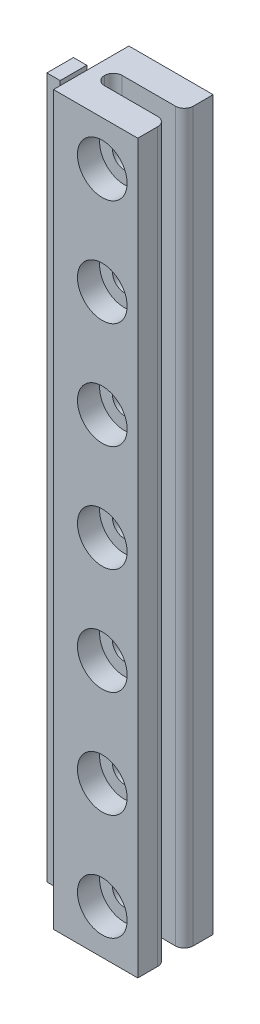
ISO-10303-21;
HEADER;
FILE_DESCRIPTION(('STEP AP214'),'2;1');
FILE_NAME('part.step','',(''),(''),'','','');
FILE_SCHEMA(('AUTOMOTIVE_DESIGN { 1 0 10303 214 1 1 1 1 }'));
ENDSEC;
DATA;
#1=APPLICATION_CONTEXT('core data for automotive mechanical design processes');
#2=APPLICATION_PROTOCOL_DEFINITION('international standard','automotive_design',2000,#1);
#3=PRODUCT_CONTEXT('',#1,'mechanical');
#4=PRODUCT('Part','Part','',(#3));
#5=PRODUCT_RELATED_PRODUCT_CATEGORY('part','',(#4));
#6=PRODUCT_DEFINITION_FORMATION('','',#4);
#7=PRODUCT_DEFINITION_CONTEXT('part definition',#1,'design');
#8=PRODUCT_DEFINITION('design','',#6,#7);
#9=PRODUCT_DEFINITION_SHAPE('','',#8);
#10=(LENGTH_UNIT() NAMED_UNIT(*) SI_UNIT(.MILLI.,.METRE.));
#11=(NAMED_UNIT(*) PLANE_ANGLE_UNIT() SI_UNIT($,.RADIAN.));
#12=(NAMED_UNIT(*) SI_UNIT($,.STERADIAN.) SOLID_ANGLE_UNIT());
#13=UNCERTAINTY_MEASURE_WITH_UNIT(LENGTH_MEASURE(1.E-05),#10,'distance_accuracy_value','');
#14=(GEOMETRIC_REPRESENTATION_CONTEXT(3) GLOBAL_UNCERTAINTY_ASSIGNED_CONTEXT((#13)) GLOBAL_UNIT_ASSIGNED_CONTEXT((#10,
#11,#12)) REPRESENTATION_CONTEXT('',''));
#15=CARTESIAN_POINT('',(0.,0.,0.));
#16=DIRECTION('',(0.,0.,1.));
#17=DIRECTION('',(1.,0.,0.));
#18=AXIS2_PLACEMENT_3D('',#15,#16,#17);
#19=CARTESIAN_POINT('',(9.,4.99999999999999,0.));
#20=DIRECTION('',(0.,0.,1.));
#21=DIRECTION('',(1.,0.,0.));
#22=AXIS2_PLACEMENT_3D('',#19,#20,#21);
#23=CYLINDRICAL_SURFACE('',#22,1.35000000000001);
#24=CARTESIAN_POINT('',(9.,4.99999999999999,3.25));
#25=DIRECTION('',(0.,0.,-1.));
#26=DIRECTION('',(-1.,0.,0.));
#27=AXIS2_PLACEMENT_3D('',#24,#25,#26);
#28=CIRCLE('',#27,1.35000000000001);
#29=CARTESIAN_POINT('',(7.64999999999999,4.99999999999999,3.25));
#30=VERTEX_POINT('',#29);
#31=EDGE_CURVE('E947',#30,#30,#28,.T.);
#32=ORIENTED_EDGE('',*,*,#31,.F.);
#33=EDGE_LOOP('',(#32));
#34=FACE_BOUND('',#33,.T.);
#35=CARTESIAN_POINT('',(9.,4.99999999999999,2.5));
#36=DIRECTION('',(0.,0.,-1.));
#37=DIRECTION('',(-1.,0.,0.));
#38=AXIS2_PLACEMENT_3D('',#35,#36,#37);
#39=CIRCLE('',#38,1.35000000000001);
#40=CARTESIAN_POINT('',(7.64999999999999,4.99999999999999,2.5));
#41=VERTEX_POINT('',#40);
#42=EDGE_CURVE('E754',#41,#41,#39,.F.);
#43=ORIENTED_EDGE('',*,*,#42,.F.);
#44=EDGE_LOOP('',(#43));
#45=FACE_BOUND('',#44,.T.);
#46=ADVANCED_FACE('F35',(#34,#45),#23,.F.);
#47=CARTESIAN_POINT('',(9.,17.,0.));
#48=DIRECTION('',(0.,0.,1.));
#49=DIRECTION('',(1.,0.,0.));
#50=AXIS2_PLACEMENT_3D('',#47,#48,#49);
#51=CYLINDRICAL_SURFACE('',#50,1.35000000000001);
#52=CARTESIAN_POINT('',(9.,17.,3.25));
#53=DIRECTION('',(0.,0.,-1.));
#54=DIRECTION('',(-1.,0.,0.));
#55=AXIS2_PLACEMENT_3D('',#52,#53,#54);
#56=CIRCLE('',#55,1.35000000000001);
#57=CARTESIAN_POINT('',(7.64999999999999,17.,3.25));
#58=VERTEX_POINT('',#57);
#59=EDGE_CURVE('E944',#58,#58,#56,.T.);
#60=ORIENTED_EDGE('',*,*,#59,.F.);
#61=EDGE_LOOP('',(#60));
#62=FACE_BOUND('',#61,.T.);
#63=CARTESIAN_POINT('',(9.,17.,2.5));
#64=DIRECTION('',(0.,0.,-1.));
#65=DIRECTION('',(-1.,0.,0.));
#66=AXIS2_PLACEMENT_3D('',#63,#64,#65);
#67=CIRCLE('',#66,1.35000000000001);
#68=CARTESIAN_POINT('',(7.64999999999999,17.,2.5));
#69=VERTEX_POINT('',#68);
#70=EDGE_CURVE('E997',#69,#69,#67,.F.);
#71=ORIENTED_EDGE('',*,*,#70,.F.);
#72=EDGE_LOOP('',(#71));
#73=FACE_BOUND('',#72,.T.);
#74=ADVANCED_FACE('F1152',(#62,#73),#51,.F.);
#75=CARTESIAN_POINT('',(9.,29.,0.));
#76=DIRECTION('',(0.,0.,1.));
#77=DIRECTION('',(1.,0.,0.));
#78=AXIS2_PLACEMENT_3D('',#75,#76,#77);
#79=CYLINDRICAL_SURFACE('',#78,1.35000000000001);
#80=CARTESIAN_POINT('',(9.,29.,3.25));
#81=DIRECTION('',(0.,0.,-1.));
#82=DIRECTION('',(-1.,0.,0.));
#83=AXIS2_PLACEMENT_3D('',#80,#81,#82);
#84=CIRCLE('',#83,1.35000000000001);
#85=CARTESIAN_POINT('',(7.64999999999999,29.,3.25));
#86=VERTEX_POINT('',#85);
#87=EDGE_CURVE('E941',#86,#86,#84,.T.);
#88=ORIENTED_EDGE('',*,*,#87,.F.);
#89=EDGE_LOOP('',(#88));
#90=FACE_BOUND('',#89,.T.);
#91=CARTESIAN_POINT('',(9.,29.,2.5));
#92=DIRECTION('',(0.,0.,-1.));
#93=DIRECTION('',(-1.,0.,0.));
#94=AXIS2_PLACEMENT_3D('',#91,#92,#93);
#95=CIRCLE('',#94,1.35000000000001);
#96=CARTESIAN_POINT('',(7.64999999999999,29.,2.5));
#97=VERTEX_POINT('',#96);
#98=EDGE_CURVE('E994',#97,#97,#95,.F.);
#99=ORIENTED_EDGE('',*,*,#98,.F.);
#100=EDGE_LOOP('',(#99));
#101=FACE_BOUND('',#100,.T.);
#102=ADVANCED_FACE('F1158',(#90,#101),#79,.F.);
#103=CARTESIAN_POINT('',(9.,41.,0.));
#104=DIRECTION('',(0.,0.,1.));
#105=DIRECTION('',(1.,0.,0.));
#106=AXIS2_PLACEMENT_3D('',#103,#104,#105);
#107=CYLINDRICAL_SURFACE('',#106,1.35000000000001);
#108=CARTESIAN_POINT('',(9.,41.,3.25));
#109=DIRECTION('',(0.,0.,-1.));
#110=DIRECTION('',(-1.,0.,0.));
#111=AXIS2_PLACEMENT_3D('',#108,#109,#110);
#112=CIRCLE('',#111,1.35000000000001);
#113=CARTESIAN_POINT('',(7.64999999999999,41.,3.25));
#114=VERTEX_POINT('',#113);
#115=EDGE_CURVE('E938',#114,#114,#112,.T.);
#116=ORIENTED_EDGE('',*,*,#115,.F.);
#117=EDGE_LOOP('',(#116));
#118=FACE_BOUND('',#117,.T.);
#119=CARTESIAN_POINT('',(9.,41.,2.5));
#120=DIRECTION('',(0.,0.,-1.));
#121=DIRECTION('',(-1.,0.,0.));
#122=AXIS2_PLACEMENT_3D('',#119,#120,#121);
#123=CIRCLE('',#122,1.35000000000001);
#124=CARTESIAN_POINT('',(7.64999999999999,41.,2.5));
#125=VERTEX_POINT('',#124);
#126=EDGE_CURVE('E991',#125,#125,#123,.F.);
#127=ORIENTED_EDGE('',*,*,#126,.F.);
#128=EDGE_LOOP('',(#127));
#129=FACE_BOUND('',#128,.T.);
#130=ADVANCED_FACE('F1916',(#118,#129),#107,.F.);
#131=CARTESIAN_POINT('',(9.,53.,0.));
#132=DIRECTION('',(0.,0.,1.));
#133=DIRECTION('',(1.,0.,0.));
#134=AXIS2_PLACEMENT_3D('',#131,#132,#133);
#135=CYLINDRICAL_SURFACE('',#134,1.35000000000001);
#136=CARTESIAN_POINT('',(9.,53.,3.25));
#137=DIRECTION('',(0.,0.,-1.));
#138=DIRECTION('',(-1.,0.,0.));
#139=AXIS2_PLACEMENT_3D('',#136,#137,#138);
#140=CIRCLE('',#139,1.35000000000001);
#141=CARTESIAN_POINT('',(7.64999999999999,53.,3.25));
#142=VERTEX_POINT('',#141);
#143=EDGE_CURVE('E933',#142,#142,#140,.T.);
#144=ORIENTED_EDGE('',*,*,#143,.F.);
#145=EDGE_LOOP('',(#144));
#146=FACE_BOUND('',#145,.T.);
#147=CARTESIAN_POINT('',(9.,53.,2.5));
#148=DIRECTION('',(0.,0.,-1.));
#149=DIRECTION('',(-1.,0.,0.));
#150=AXIS2_PLACEMENT_3D('',#147,#148,#149);
#151=CIRCLE('',#150,1.35000000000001);
#152=CARTESIAN_POINT('',(7.64999999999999,53.,2.5));
#153=VERTEX_POINT('',#152);
#154=EDGE_CURVE('E988',#153,#153,#151,.F.);
#155=ORIENTED_EDGE('',*,*,#154,.F.);
#156=EDGE_LOOP('',(#155));
#157=FACE_BOUND('',#156,.T.);
#158=ADVANCED_FACE('F1908',(#146,#157),#135,.F.);
#159=CARTESIAN_POINT('',(9.,65.,0.));
#160=DIRECTION('',(0.,0.,1.));
#161=DIRECTION('',(1.,0.,0.));
#162=AXIS2_PLACEMENT_3D('',#159,#160,#161);
#163=CYLINDRICAL_SURFACE('',#162,1.35000000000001);
#164=CARTESIAN_POINT('',(9.,65.,3.25));
#165=DIRECTION('',(0.,0.,-1.));
#166=DIRECTION('',(-1.,0.,0.));
#167=AXIS2_PLACEMENT_3D('',#164,#165,#166);
#168=CIRCLE('',#167,1.35000000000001);
#169=CARTESIAN_POINT('',(7.64999999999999,65.,3.25));
#170=VERTEX_POINT('',#169);
#171=EDGE_CURVE('E829',#170,#170,#168,.T.);
#172=ORIENTED_EDGE('',*,*,#171,.F.);
#173=EDGE_LOOP('',(#172));
#174=FACE_BOUND('',#173,.T.);
#175=CARTESIAN_POINT('',(9.,65.,2.5));
#176=DIRECTION('',(0.,0.,-1.));
#177=DIRECTION('',(-1.,0.,0.));
#178=AXIS2_PLACEMENT_3D('',#175,#176,#177);
#179=CIRCLE('',#178,1.35000000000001);
#180=CARTESIAN_POINT('',(7.64999999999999,65.,2.5));
#181=VERTEX_POINT('',#180);
#182=EDGE_CURVE('E483',#181,#181,#179,.F.);
#183=ORIENTED_EDGE('',*,*,#182,.F.);
#184=EDGE_LOOP('',(#183));
#185=FACE_BOUND('',#184,.T.);
#186=ADVANCED_FACE('F1902',(#174,#185),#163,.F.);
#187=CARTESIAN_POINT('',(9.,77.,0.));
#188=DIRECTION('',(0.,0.,1.));
#189=DIRECTION('',(1.,0.,0.));
#190=AXIS2_PLACEMENT_3D('',#187,#188,#189);
#191=CYLINDRICAL_SURFACE('',#190,1.35000000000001);
#192=CARTESIAN_POINT('',(9.,77.,3.25));
#193=DIRECTION('',(0.,0.,-1.));
#194=DIRECTION('',(-1.,0.,0.));
#195=AXIS2_PLACEMENT_3D('',#192,#193,#194);
#196=CIRCLE('',#195,1.35000000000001);
#197=CARTESIAN_POINT('',(7.64999999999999,77.,3.25));
#198=VERTEX_POINT('',#197);
#199=EDGE_CURVE('E833',#198,#198,#196,.T.);
#200=ORIENTED_EDGE('',*,*,#199,.F.);
#201=EDGE_LOOP('',(#200));
#202=FACE_BOUND('',#201,.T.);
#203=CARTESIAN_POINT('',(9.,77.,2.5));
#204=DIRECTION('',(0.,0.,-1.));
#205=DIRECTION('',(-1.,0.,0.));
#206=AXIS2_PLACEMENT_3D('',#203,#204,#205);
#207=CIRCLE('',#206,1.35000000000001);
#208=CARTESIAN_POINT('',(7.64999999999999,77.,2.5));
#209=VERTEX_POINT('',#208);
#210=EDGE_CURVE('E770',#209,#209,#207,.F.);
#211=ORIENTED_EDGE('',*,*,#210,.F.);
#212=EDGE_LOOP('',(#211));
#213=FACE_BOUND('',#212,.T.);
#214=ADVANCED_FACE('F1185',(#202,#213),#191,.F.);
#215=CARTESIAN_POINT('',(9.,4.99999999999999,0.));
#216=DIRECTION('',(0.,0.,1.));
#217=DIRECTION('',(1.,0.,0.));
#218=AXIS2_PLACEMENT_3D('',#215,#216,#217);
#219=CYLINDRICAL_SURFACE('',#218,1.35000000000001);
#220=CARTESIAN_POINT('',(9.,4.99999999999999,5.25));
#221=DIRECTION('',(0.,0.,1.));
#222=DIRECTION('',(1.,0.,0.));
#223=AXIS2_PLACEMENT_3D('',#220,#221,#222);
#224=CIRCLE('',#223,1.35000000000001);
#225=CARTESIAN_POINT('',(10.35,4.99999999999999,5.25));
#226=VERTEX_POINT('',#225);
#227=EDGE_CURVE('E962',#226,#226,#224,.T.);
#228=ORIENTED_EDGE('',*,*,#227,.F.);
#229=EDGE_LOOP('',(#228));
#230=FACE_BOUND('',#229,.T.);
#231=CARTESIAN_POINT('',(9.,4.99999999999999,6.));
#232=DIRECTION('',(0.,0.,1.));
#233=DIRECTION('',(1.,0.,0.));
#234=AXIS2_PLACEMENT_3D('',#231,#232,#233);
#235=CIRCLE('',#234,1.35000000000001);
#236=CARTESIAN_POINT('',(10.35,4.99999999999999,6.));
#237=VERTEX_POINT('',#236);
#238=EDGE_CURVE('E825',#237,#237,#235,.F.);
#239=ORIENTED_EDGE('',*,*,#238,.F.);
#240=EDGE_LOOP('',(#239));
#241=FACE_BOUND('',#240,.T.);
#242=ADVANCED_FACE('F1181',(#230,#241),#219,.F.);
#243=CARTESIAN_POINT('',(9.,17.,0.));
#244=DIRECTION('',(0.,0.,1.));
#245=DIRECTION('',(1.,0.,0.));
#246=AXIS2_PLACEMENT_3D('',#243,#244,#245);
#247=CYLINDRICAL_SURFACE('',#246,1.35000000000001);
#248=CARTESIAN_POINT('',(9.,17.,5.25));
#249=DIRECTION('',(0.,0.,1.));
#250=DIRECTION('',(1.,0.,0.));
#251=AXIS2_PLACEMENT_3D('',#248,#249,#250);
#252=CIRCLE('',#251,1.35000000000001);
#253=CARTESIAN_POINT('',(10.35,17.,5.25));
#254=VERTEX_POINT('',#253);
#255=EDGE_CURVE('E959',#254,#254,#252,.T.);
#256=ORIENTED_EDGE('',*,*,#255,.F.);
#257=EDGE_LOOP('',(#256));
#258=FACE_BOUND('',#257,.T.);
#259=CARTESIAN_POINT('',(9.,17.,6.));
#260=DIRECTION('',(0.,0.,1.));
#261=DIRECTION('',(1.,0.,0.));
#262=AXIS2_PLACEMENT_3D('',#259,#260,#261);
#263=CIRCLE('',#262,1.35000000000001);
#264=CARTESIAN_POINT('',(10.35,17.,6.));
#265=VERTEX_POINT('',#264);
#266=EDGE_CURVE('E979',#265,#265,#263,.F.);
#267=ORIENTED_EDGE('',*,*,#266,.F.);
#268=EDGE_LOOP('',(#267));
#269=FACE_BOUND('',#268,.T.);
#270=ADVANCED_FACE('F1177',(#258,#269),#247,.F.);
#271=CARTESIAN_POINT('',(9.,29.,0.));
#272=DIRECTION('',(0.,0.,1.));
#273=DIRECTION('',(1.,0.,0.));
#274=AXIS2_PLACEMENT_3D('',#271,#272,#273);
#275=CYLINDRICAL_SURFACE('',#274,1.35000000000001);
#276=CARTESIAN_POINT('',(9.,29.,5.25));
#277=DIRECTION('',(0.,0.,1.));
#278=DIRECTION('',(1.,0.,0.));
#279=AXIS2_PLACEMENT_3D('',#276,#277,#278);
#280=CIRCLE('',#279,1.35000000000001);
#281=CARTESIAN_POINT('',(10.35,29.,5.25));
#282=VERTEX_POINT('',#281);
#283=EDGE_CURVE('E956',#282,#282,#280,.T.);
#284=ORIENTED_EDGE('',*,*,#283,.F.);
#285=EDGE_LOOP('',(#284));
#286=FACE_BOUND('',#285,.T.);
#287=CARTESIAN_POINT('',(9.,29.,6.));
#288=DIRECTION('',(0.,0.,1.));
#289=DIRECTION('',(1.,0.,0.));
#290=AXIS2_PLACEMENT_3D('',#287,#288,#289);
#291=CIRCLE('',#290,1.35000000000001);
#292=CARTESIAN_POINT('',(10.35,29.,6.));
#293=VERTEX_POINT('',#292);
#294=EDGE_CURVE('E976',#293,#293,#291,.F.);
#295=ORIENTED_EDGE('',*,*,#294,.F.);
#296=EDGE_LOOP('',(#295));
#297=FACE_BOUND('',#296,.T.);
#298=ADVANCED_FACE('F1173',(#286,#297),#275,.F.);
#299=CARTESIAN_POINT('',(9.,41.,0.));
#300=DIRECTION('',(0.,0.,1.));
#301=DIRECTION('',(1.,0.,0.));
#302=AXIS2_PLACEMENT_3D('',#299,#300,#301);
#303=CYLINDRICAL_SURFACE('',#302,1.35000000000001);
#304=CARTESIAN_POINT('',(9.,41.,5.25));
#305=DIRECTION('',(0.,0.,1.));
#306=DIRECTION('',(1.,0.,0.));
#307=AXIS2_PLACEMENT_3D('',#304,#305,#306);
#308=CIRCLE('',#307,1.35000000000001);
#309=CARTESIAN_POINT('',(10.35,41.,5.25));
#310=VERTEX_POINT('',#309);
#311=EDGE_CURVE('E953',#310,#310,#308,.T.);
#312=ORIENTED_EDGE('',*,*,#311,.F.);
#313=EDGE_LOOP('',(#312));
#314=FACE_BOUND('',#313,.T.);
#315=CARTESIAN_POINT('',(9.,41.,6.));
#316=DIRECTION('',(0.,0.,1.));
#317=DIRECTION('',(1.,0.,0.));
#318=AXIS2_PLACEMENT_3D('',#315,#316,#317);
#319=CIRCLE('',#318,1.35000000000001);
#320=CARTESIAN_POINT('',(10.35,41.,6.));
#321=VERTEX_POINT('',#320);
#322=EDGE_CURVE('E973',#321,#321,#319,.F.);
#323=ORIENTED_EDGE('',*,*,#322,.F.);
#324=EDGE_LOOP('',(#323));
#325=FACE_BOUND('',#324,.T.);
#326=ADVANCED_FACE('F1169',(#314,#325),#303,.F.);
#327=CARTESIAN_POINT('',(9.,53.,0.));
#328=DIRECTION('',(0.,0.,1.));
#329=DIRECTION('',(1.,0.,0.));
#330=AXIS2_PLACEMENT_3D('',#327,#328,#329);
#331=CYLINDRICAL_SURFACE('',#330,1.35000000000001);
#332=CARTESIAN_POINT('',(9.,53.,5.25));
#333=DIRECTION('',(0.,0.,1.));
#334=DIRECTION('',(1.,0.,0.));
#335=AXIS2_PLACEMENT_3D('',#332,#333,#334);
#336=CIRCLE('',#335,1.35000000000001);
#337=CARTESIAN_POINT('',(10.35,53.,5.25));
#338=VERTEX_POINT('',#337);
#339=EDGE_CURVE('E950',#338,#338,#336,.T.);
#340=ORIENTED_EDGE('',*,*,#339,.F.);
#341=EDGE_LOOP('',(#340));
#342=FACE_BOUND('',#341,.T.);
#343=CARTESIAN_POINT('',(9.,53.,6.));
#344=DIRECTION('',(0.,0.,1.));
#345=DIRECTION('',(1.,0.,0.));
#346=AXIS2_PLACEMENT_3D('',#343,#344,#345);
#347=CIRCLE('',#346,1.35000000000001);
#348=CARTESIAN_POINT('',(10.35,53.,6.));
#349=VERTEX_POINT('',#348);
#350=EDGE_CURVE('E970',#349,#349,#347,.F.);
#351=ORIENTED_EDGE('',*,*,#350,.F.);
#352=EDGE_LOOP('',(#351));
#353=FACE_BOUND('',#352,.T.);
#354=ADVANCED_FACE('F1165',(#342,#353),#331,.F.);
#355=CARTESIAN_POINT('',(9.,65.,0.));
#356=DIRECTION('',(0.,0.,1.));
#357=DIRECTION('',(1.,0.,0.));
#358=AXIS2_PLACEMENT_3D('',#355,#356,#357);
#359=CYLINDRICAL_SURFACE('',#358,1.35000000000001);
#360=CARTESIAN_POINT('',(9.,65.,5.25));
#361=DIRECTION('',(0.,0.,1.));
#362=DIRECTION('',(1.,0.,0.));
#363=AXIS2_PLACEMENT_3D('',#360,#361,#362);
#364=CIRCLE('',#363,1.35000000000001);
#365=CARTESIAN_POINT('',(10.35,65.,5.25));
#366=VERTEX_POINT('',#365);
#367=EDGE_CURVE('E826',#366,#366,#364,.T.);
#368=ORIENTED_EDGE('',*,*,#367,.F.);
#369=EDGE_LOOP('',(#368));
#370=FACE_BOUND('',#369,.T.);
#371=CARTESIAN_POINT('',(9.,65.,6.));
#372=DIRECTION('',(0.,0.,1.));
#373=DIRECTION('',(1.,0.,0.));
#374=AXIS2_PLACEMENT_3D('',#371,#372,#373);
#375=CIRCLE('',#374,1.35000000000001);
#376=CARTESIAN_POINT('',(10.35,65.,6.));
#377=VERTEX_POINT('',#376);
#378=EDGE_CURVE('E784',#377,#377,#375,.F.);
#379=ORIENTED_EDGE('',*,*,#378,.F.);
#380=EDGE_LOOP('',(#379));
#381=FACE_BOUND('',#380,.T.);
#382=ADVANCED_FACE('F1168',(#370,#381),#359,.F.);
#383=CARTESIAN_POINT('',(9.,77.,5.25));
#384=DIRECTION('',(0.,0.,1.));
#385=DIRECTION('',(1.,0.,0.));
#386=AXIS2_PLACEMENT_3D('',#383,#384,#385);
#387=CIRCLE('',#386,1.35000000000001);
#388=CARTESIAN_POINT('',(10.35,77.,5.25));
#389=VERTEX_POINT('',#388);
#390=EDGE_CURVE('E832',#389,#389,#387,.T.);
#391=ORIENTED_EDGE('',*,*,#390,.F.);
#392=EDGE_LOOP('',(#391));
#393=FACE_BOUND('',#392,.T.);
#394=CARTESIAN_POINT('',(9.,77.,6.));
#395=DIRECTION('',(0.,0.,1.));
#396=DIRECTION('',(1.,0.,0.));
#397=AXIS2_PLACEMENT_3D('',#394,#395,#396);
#398=CIRCLE('',#397,1.35000000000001);
#399=CARTESIAN_POINT('',(10.35,77.,6.));
#400=VERTEX_POINT('',#399);
#401=EDGE_CURVE('E821',#400,#400,#398,.F.);
#402=ORIENTED_EDGE('',*,*,#401,.F.);
#403=EDGE_LOOP('',(#402));
#404=FACE_BOUND('',#403,.T.);
#405=ADVANCED_FACE('F1864',(#393,#404),#191,.F.);
#406=CARTESIAN_POINT('',(0.,82.,8.5));
#407=DIRECTION('',(0.,-1.,0.));
#408=DIRECTION('',(0.,0.,-1.));
#409=AXIS2_PLACEMENT_3D('',#406,#407,#408);
#410=PLANE('',#409);
#411=DIRECTION('',(-1.,0.,0.));
#412=VECTOR('',#411,1.);
#413=CARTESIAN_POINT('',(5.,82.,3.25));
#414=LINE('',#413,#412);
#415=CARTESIAN_POINT('',(12.,82.,3.25));
#416=VERTEX_POINT('',#415);
#417=CARTESIAN_POINT('',(6.,82.,3.25));
#418=VERTEX_POINT('',#417);
#419=EDGE_CURVE('E902',#416,#418,#414,.T.);
#420=ORIENTED_EDGE('',*,*,#419,.F.);
#421=CARTESIAN_POINT('',(12.,82.,2.25));
#422=DIRECTION('',(0.,-1.,0.));
#423=DIRECTION('',(0.,0.,-1.));
#424=AXIS2_PLACEMENT_3D('',#421,#422,#423);
#425=CIRCLE('',#424,1.);
#426=CARTESIAN_POINT('',(13.,82.,2.25));
#427=VERTEX_POINT('',#426);
#428=EDGE_CURVE('E1009',#416,#427,#425,.F.);
#429=ORIENTED_EDGE('',*,*,#428,.T.);
#430=DIRECTION('',(0.,0.,-1.));
#431=VECTOR('',#430,1.);
#432=CARTESIAN_POINT('',(13.,82.,8.5));
#433=LINE('',#432,#431);
#434=CARTESIAN_POINT('',(13.,82.,0.));
#435=VERTEX_POINT('',#434);
#436=EDGE_CURVE('E918',#427,#435,#433,.T.);
#437=ORIENTED_EDGE('',*,*,#436,.T.);
#438=DIRECTION('',(-1.,0.,0.));
#439=VECTOR('',#438,1.);
#440=CARTESIAN_POINT('',(0.,82.,0.));
#441=LINE('',#440,#439);
#442=CARTESIAN_POINT('',(3.5,82.,0.));
#443=VERTEX_POINT('',#442);
#444=EDGE_CURVE('E913',#435,#443,#441,.T.);
#445=ORIENTED_EDGE('',*,*,#444,.T.);
#446=DIRECTION('',(0.,0.,1.));
#447=VECTOR('',#446,1.);
#448=CARTESIAN_POINT('',(3.5,82.,4.95));
#449=LINE('',#448,#447);
#450=CARTESIAN_POINT('',(3.5,82.,8.5));
#451=VERTEX_POINT('',#450);
#452=EDGE_CURVE('E869',#443,#451,#449,.T.);
#453=ORIENTED_EDGE('',*,*,#452,.T.);
#454=DIRECTION('',(-1.,0.,0.));
#455=VECTOR('',#454,1.);
#456=CARTESIAN_POINT('',(0.,82.,8.5));
#457=LINE('',#456,#455);
#458=CARTESIAN_POINT('',(13.,82.,8.5));
#459=VERTEX_POINT('',#458);
#460=EDGE_CURVE('E915',#459,#451,#457,.T.);
#461=ORIENTED_EDGE('',*,*,#460,.F.);
#462=CARTESIAN_POINT('',(13.,82.,6.25));
#463=VERTEX_POINT('',#462);
#464=EDGE_CURVE('E926',#459,#463,#433,.T.);
#465=ORIENTED_EDGE('',*,*,#464,.T.);
#466=CARTESIAN_POINT('',(12.,82.,6.25));
#467=DIRECTION('',(0.,-1.,0.));
#468=DIRECTION('',(0.,0.,-1.));
#469=AXIS2_PLACEMENT_3D('',#466,#467,#468);
#470=CIRCLE('',#469,1.);
#471=CARTESIAN_POINT('',(12.,82.,5.25));
#472=VERTEX_POINT('',#471);
#473=EDGE_CURVE('E1007',#463,#472,#470,.F.);
#474=ORIENTED_EDGE('',*,*,#473,.T.);
#475=DIRECTION('',(1.,0.,0.));
#476=VECTOR('',#475,1.);
#477=CARTESIAN_POINT('',(5.,82.,5.25));
#478=LINE('',#477,#476);
#479=CARTESIAN_POINT('',(6.,82.,5.25));
#480=VERTEX_POINT('',#479);
#481=EDGE_CURVE('E879',#480,#472,#478,.T.);
#482=ORIENTED_EDGE('',*,*,#481,.F.);
#483=CARTESIAN_POINT('',(6.,82.,4.25));
#484=DIRECTION('',(0.,-1.,0.));
#485=DIRECTION('',(0.,0.,-1.));
#486=AXIS2_PLACEMENT_3D('',#483,#484,#485);
#487=CIRCLE('',#486,1.);
#488=CARTESIAN_POINT('',(5.,82.,4.25));
#489=VERTEX_POINT('',#488);
#490=EDGE_CURVE('E1028',#480,#489,#487,.T.);
#491=ORIENTED_EDGE('',*,*,#490,.T.);
#492=CARTESIAN_POINT('',(6.,82.,4.25));
#493=DIRECTION('',(0.,-1.,0.));
#494=DIRECTION('',(0.,0.,-1.));
#495=AXIS2_PLACEMENT_3D('',#492,#493,#494);
#496=CIRCLE('',#495,1.);
#497=EDGE_CURVE('E1024',#489,#418,#496,.T.);
#498=ORIENTED_EDGE('',*,*,#497,.T.);
#499=EDGE_LOOP('',(#420,#429,#437,#445,#453,#461,#465,#474,#482,#491,#498));
#500=FACE_BOUND('',#499,.T.);
#501=ADVANCED_FACE('F1104',(#500),#410,.F.);
#502=CARTESIAN_POINT('',(13.,0.,8.5));
#503=DIRECTION('',(-1.,0.,0.));
#504=DIRECTION('',(0.,0.,1.));
#505=AXIS2_PLACEMENT_3D('',#502,#503,#504);
#506=PLANE('',#505);
#507=ORIENTED_EDGE('',*,*,#436,.F.);
#508=DIRECTION('',(0.,1.,0.));
#509=VECTOR('',#508,1.);
#510=CARTESIAN_POINT('',(13.,0.,2.25));
#511=LINE('',#510,#509);
#512=CARTESIAN_POINT('',(13.,0.,2.25));
#513=VERTEX_POINT('',#512);
#514=EDGE_CURVE('E1011',#427,#513,#511,.F.);
#515=ORIENTED_EDGE('',*,*,#514,.T.);
#516=DIRECTION('',(0.,0.,-1.));
#517=VECTOR('',#516,1.);
#518=CARTESIAN_POINT('',(13.,0.,8.5));
#519=LINE('',#518,#517);
#520=CARTESIAN_POINT('',(13.,0.,0.));
#521=VERTEX_POINT('',#520);
#522=EDGE_CURVE('E929',#513,#521,#519,.T.);
#523=ORIENTED_EDGE('',*,*,#522,.T.);
#524=DIRECTION('',(0.,1.,0.));
#525=VECTOR('',#524,1.);
#526=CARTESIAN_POINT('',(13.,0.,0.));
#527=LINE('',#526,#525);
#528=EDGE_CURVE('E921',#521,#435,#527,.T.);
#529=ORIENTED_EDGE('',*,*,#528,.T.);
#530=EDGE_LOOP('',(#507,#515,#523,#529));
#531=FACE_BOUND('',#530,.T.);
#532=ADVANCED_FACE('F1108',(#531),#506,.F.);
#533=CARTESIAN_POINT('',(0.,0.,8.5));
#534=DIRECTION('',(1.,0.,0.));
#535=DIRECTION('',(0.,0.,-1.));
#536=AXIS2_PLACEMENT_3D('',#533,#534,#535);
#537=PLANE('',#536);
#538=DIRECTION('',(0.,-1.,0.));
#539=VECTOR('',#538,1.);
#540=CARTESIAN_POINT('',(0.,82.,5.75));
#541=LINE('',#540,#539);
#542=CARTESIAN_POINT('',(0.,80.5,5.75));
#543=VERTEX_POINT('',#542);
#544=CARTESIAN_POINT('',(0.,1.5,5.75000000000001));
#545=VERTEX_POINT('',#544);
#546=EDGE_CURVE('E872',#543,#545,#541,.T.);
#547=ORIENTED_EDGE('',*,*,#546,.F.);
#548=DIRECTION('',(0.,0.,1.));
#549=VECTOR('',#548,1.);
#550=CARTESIAN_POINT('',(0.,80.5,5.75));
#551=LINE('',#550,#549);
#552=CARTESIAN_POINT('',(0.,80.5,2.75));
#553=VERTEX_POINT('',#552);
#554=EDGE_CURVE('E837',#553,#543,#551,.T.);
#555=ORIENTED_EDGE('',*,*,#554,.F.);
#556=DIRECTION('',(0.,-1.,0.));
#557=VECTOR('',#556,1.);
#558=CARTESIAN_POINT('',(0.,82.,2.75));
#559=LINE('',#558,#557);
#560=CARTESIAN_POINT('',(0.,1.5,2.75));
#561=VERTEX_POINT('',#560);
#562=EDGE_CURVE('E876',#553,#561,#559,.T.);
#563=ORIENTED_EDGE('',*,*,#562,.T.);
#564=DIRECTION('',(0.,0.,-1.));
#565=VECTOR('',#564,1.);
#566=CARTESIAN_POINT('',(0.,1.5,5.75000000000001));
#567=LINE('',#566,#565);
#568=EDGE_CURVE('E849',#545,#561,#567,.T.);
#569=ORIENTED_EDGE('',*,*,#568,.F.);
#570=EDGE_LOOP('',(#547,#555,#563,#569));
#571=FACE_BOUND('',#570,.T.);
#572=ADVANCED_FACE('F1147',(#571),#537,.F.);
#573=CARTESIAN_POINT('',(0.,0.,8.5));
#574=DIRECTION('',(0.,1.,0.));
#575=DIRECTION('',(0.,0.,1.));
#576=AXIS2_PLACEMENT_3D('',#573,#574,#575);
#577=PLANE('',#576);
#578=ORIENTED_EDGE('',*,*,#522,.F.);
#579=CARTESIAN_POINT('',(12.,0.,2.25));
#580=DIRECTION('',(0.,1.,0.));
#581=DIRECTION('',(0.,0.,1.));
#582=AXIS2_PLACEMENT_3D('',#579,#580,#581);
#583=CIRCLE('',#582,1.);
#584=CARTESIAN_POINT('',(12.,0.,3.25));
#585=VERTEX_POINT('',#584);
#586=EDGE_CURVE('E1015',#513,#585,#583,.F.);
#587=ORIENTED_EDGE('',*,*,#586,.T.);
#588=DIRECTION('',(-1.,0.,0.));
#589=VECTOR('',#588,1.);
#590=CARTESIAN_POINT('',(5.,0.,3.25));
#591=LINE('',#590,#589);
#592=CARTESIAN_POINT('',(6.,0.,3.25));
#593=VERTEX_POINT('',#592);
#594=EDGE_CURVE('E901',#585,#593,#591,.T.);
#595=ORIENTED_EDGE('',*,*,#594,.T.);
#596=CARTESIAN_POINT('',(6.,0.,4.25));
#597=DIRECTION('',(0.,1.,0.));
#598=DIRECTION('',(0.,0.,1.));
#599=AXIS2_PLACEMENT_3D('',#596,#597,#598);
#600=CIRCLE('',#599,1.);
#601=CARTESIAN_POINT('',(5.,0.,4.25));
#602=VERTEX_POINT('',#601);
#603=EDGE_CURVE('E1026',#593,#602,#600,.T.);
#604=ORIENTED_EDGE('',*,*,#603,.T.);
#605=CARTESIAN_POINT('',(6.,0.,4.25));
#606=DIRECTION('',(0.,1.,0.));
#607=DIRECTION('',(0.,0.,1.));
#608=AXIS2_PLACEMENT_3D('',#605,#606,#607);
#609=CIRCLE('',#608,1.);
#610=CARTESIAN_POINT('',(6.,0.,5.25));
#611=VERTEX_POINT('',#610);
#612=EDGE_CURVE('E1030',#602,#611,#609,.T.);
#613=ORIENTED_EDGE('',*,*,#612,.T.);
#614=DIRECTION('',(1.,0.,0.));
#615=VECTOR('',#614,1.);
#616=CARTESIAN_POINT('',(5.,0.,5.25));
#617=LINE('',#616,#615);
#618=CARTESIAN_POINT('',(12.,0.,5.25));
#619=VERTEX_POINT('',#618);
#620=EDGE_CURVE('E898',#611,#619,#617,.T.);
#621=ORIENTED_EDGE('',*,*,#620,.T.);
#622=CARTESIAN_POINT('',(12.,0.,6.25));
#623=DIRECTION('',(0.,1.,0.));
#624=DIRECTION('',(0.,0.,1.));
#625=AXIS2_PLACEMENT_3D('',#622,#623,#624);
#626=CIRCLE('',#625,1.);
#627=CARTESIAN_POINT('',(13.,0.,6.25));
#628=VERTEX_POINT('',#627);
#629=EDGE_CURVE('E1013',#619,#628,#626,.F.);
#630=ORIENTED_EDGE('',*,*,#629,.T.);
#631=CARTESIAN_POINT('',(13.,0.,8.5));
#632=VERTEX_POINT('',#631);
#633=EDGE_CURVE('E930',#632,#628,#519,.T.);
#634=ORIENTED_EDGE('',*,*,#633,.F.);
#635=DIRECTION('',(1.,0.,0.));
#636=VECTOR('',#635,1.);
#637=CARTESIAN_POINT('',(0.,0.,8.5));
#638=LINE('',#637,#636);
#639=CARTESIAN_POINT('',(3.5,0.,8.5));
#640=VERTEX_POINT('',#639);
#641=EDGE_CURVE('E910',#640,#632,#638,.T.);
#642=ORIENTED_EDGE('',*,*,#641,.F.);
#643=DIRECTION('',(0.,0.,1.));
#644=VECTOR('',#643,1.);
#645=CARTESIAN_POINT('',(3.5,0.,4.95));
#646=LINE('',#645,#644);
#647=CARTESIAN_POINT('',(3.5,0.,0.));
#648=VERTEX_POINT('',#647);
#649=EDGE_CURVE('E873',#648,#640,#646,.T.);
#650=ORIENTED_EDGE('',*,*,#649,.F.);
#651=DIRECTION('',(1.,0.,0.));
#652=VECTOR('',#651,1.);
#653=CARTESIAN_POINT('',(0.,0.,0.));
#654=LINE('',#653,#652);
#655=EDGE_CURVE('E905',#648,#521,#654,.T.);
#656=ORIENTED_EDGE('',*,*,#655,.T.);
#657=EDGE_LOOP('',(#578,#587,#595,#604,#613,#621,#630,#634,#642,#650,#656));
#658=FACE_BOUND('',#657,.T.);
#659=ADVANCED_FACE('F1094',(#658),#577,.F.);
#660=ORIENTED_EDGE('',*,*,#633,.T.);
#661=DIRECTION('',(0.,1.,0.));
#662=VECTOR('',#661,1.);
#663=CARTESIAN_POINT('',(13.,0.,6.25));
#664=LINE('',#663,#662);
#665=EDGE_CURVE('E1017',#628,#463,#664,.T.);
#666=ORIENTED_EDGE('',*,*,#665,.T.);
#667=ORIENTED_EDGE('',*,*,#464,.F.);
#668=DIRECTION('',(0.,1.,0.));
#669=VECTOR('',#668,1.);
#670=CARTESIAN_POINT('',(13.,0.,8.5));
#671=LINE('',#670,#669);
#672=EDGE_CURVE('E912',#632,#459,#671,.T.);
#673=ORIENTED_EDGE('',*,*,#672,.F.);
#674=EDGE_LOOP('',(#660,#666,#667,#673));
#675=FACE_BOUND('',#674,.T.);
#676=ADVANCED_FACE('F1137',(#675),#506,.F.);
#677=CARTESIAN_POINT('',(0.,0.,8.5));
#678=DIRECTION('',(0.,0.,-1.));
#679=DIRECTION('',(-1.,0.,0.));
#680=AXIS2_PLACEMENT_3D('',#677,#678,#679);
#681=PLANE('',#680);
#682=CARTESIAN_POINT('',(9.,65.,8.5));
#683=DIRECTION('',(0.,0.,1.));
#684=DIRECTION('',(1.,0.,0.));
#685=AXIS2_PLACEMENT_3D('',#682,#683,#684);
#686=CIRCLE('',#685,2.8);
#687=CARTESIAN_POINT('',(11.8,65.,8.5));
#688=VERTEX_POINT('',#687);
#689=EDGE_CURVE('E785',#688,#688,#686,.T.);
#690=ORIENTED_EDGE('',*,*,#689,.F.);
#691=EDGE_LOOP('',(#690));
#692=FACE_BOUND('',#691,.T.);
#693=CARTESIAN_POINT('',(9.,53.,8.5));
#694=DIRECTION('',(0.,0.,1.));
#695=DIRECTION('',(1.,0.,0.));
#696=AXIS2_PLACEMENT_3D('',#693,#694,#695);
#697=CIRCLE('',#696,2.8);
#698=CARTESIAN_POINT('',(11.8,53.,8.5));
#699=VERTEX_POINT('',#698);
#700=EDGE_CURVE('E791',#699,#699,#697,.T.);
#701=ORIENTED_EDGE('',*,*,#700,.F.);
#702=EDGE_LOOP('',(#701));
#703=FACE_BOUND('',#702,.T.);
#704=CARTESIAN_POINT('',(9.,41.,8.5));
#705=DIRECTION('',(0.,0.,1.));
#706=DIRECTION('',(1.,0.,0.));
#707=AXIS2_PLACEMENT_3D('',#704,#705,#706);
#708=CIRCLE('',#707,2.8);
#709=CARTESIAN_POINT('',(11.8,41.,8.5));
#710=VERTEX_POINT('',#709);
#711=EDGE_CURVE('E797',#710,#710,#708,.T.);
#712=ORIENTED_EDGE('',*,*,#711,.F.);
#713=EDGE_LOOP('',(#712));
#714=FACE_BOUND('',#713,.T.);
#715=CARTESIAN_POINT('',(9.,29.,8.5));
#716=DIRECTION('',(0.,0.,1.));
#717=DIRECTION('',(1.,0.,0.));
#718=AXIS2_PLACEMENT_3D('',#715,#716,#717);
#719=CIRCLE('',#718,2.8);
#720=CARTESIAN_POINT('',(11.8,29.,8.5));
#721=VERTEX_POINT('',#720);
#722=EDGE_CURVE('E803',#721,#721,#719,.T.);
#723=ORIENTED_EDGE('',*,*,#722,.F.);
#724=EDGE_LOOP('',(#723));
#725=FACE_BOUND('',#724,.T.);
#726=CARTESIAN_POINT('',(9.,17.,8.5));
#727=DIRECTION('',(0.,0.,1.));
#728=DIRECTION('',(1.,0.,0.));
#729=AXIS2_PLACEMENT_3D('',#726,#727,#728);
#730=CIRCLE('',#729,2.8);
#731=CARTESIAN_POINT('',(11.8,17.,8.5));
#732=VERTEX_POINT('',#731);
#733=EDGE_CURVE('E809',#732,#732,#730,.T.);
#734=ORIENTED_EDGE('',*,*,#733,.F.);
#735=EDGE_LOOP('',(#734));
#736=FACE_BOUND('',#735,.T.);
#737=CARTESIAN_POINT('',(9.,4.99999999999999,8.5));
#738=DIRECTION('',(0.,0.,1.));
#739=DIRECTION('',(1.,0.,0.));
#740=AXIS2_PLACEMENT_3D('',#737,#738,#739);
#741=CIRCLE('',#740,2.8);
#742=CARTESIAN_POINT('',(11.8,4.99999999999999,8.5));
#743=VERTEX_POINT('',#742);
#744=EDGE_CURVE('E815',#743,#743,#741,.T.);
#745=ORIENTED_EDGE('',*,*,#744,.F.);
#746=EDGE_LOOP('',(#745));
#747=FACE_BOUND('',#746,.T.);
#748=CARTESIAN_POINT('',(9.,77.,8.5));
#749=DIRECTION('',(0.,0.,1.));
#750=DIRECTION('',(1.,0.,0.));
#751=AXIS2_PLACEMENT_3D('',#748,#749,#750);
#752=CIRCLE('',#751,2.8);
#753=CARTESIAN_POINT('',(11.8,77.,8.5));
#754=VERTEX_POINT('',#753);
#755=EDGE_CURVE('E822',#754,#754,#752,.T.);
#756=ORIENTED_EDGE('',*,*,#755,.F.);
#757=EDGE_LOOP('',(#756));
#758=FACE_BOUND('',#757,.T.);
#759=ORIENTED_EDGE('',*,*,#460,.T.);
#760=DIRECTION('',(0.,-1.,0.));
#761=VECTOR('',#760,1.);
#762=CARTESIAN_POINT('',(3.5,82.,8.5));
#763=LINE('',#762,#761);
#764=EDGE_CURVE('E877',#451,#640,#763,.T.);
#765=ORIENTED_EDGE('',*,*,#764,.T.);
#766=ORIENTED_EDGE('',*,*,#641,.T.);
#767=ORIENTED_EDGE('',*,*,#672,.T.);
#768=EDGE_LOOP('',(#759,#765,#766,#767));
#769=FACE_BOUND('',#768,.T.);
#770=ADVANCED_FACE('F1099',(#692,#703,#714,#725,#736,#747,#758,#769),#681,.F.);
#771=CARTESIAN_POINT('',(0.,0.,0.));
#772=DIRECTION('',(0.,0.,-1.));
#773=DIRECTION('',(-1.,0.,0.));
#774=AXIS2_PLACEMENT_3D('',#771,#772,#773);
#775=PLANE('',#774);
#776=DIRECTION('',(-0.5,0.866025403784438,0.));
#777=VECTOR('',#776,1.);
#778=CARTESIAN_POINT('',(7.42672051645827,62.275,0.));
#779=LINE('',#778,#777);
#780=CARTESIAN_POINT('',(7.42672051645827,62.275,0.));
#781=VERTEX_POINT('',#780);
#782=CARTESIAN_POINT('',(5.85344103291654,65.,0.));
#783=VERTEX_POINT('',#782);
#784=EDGE_CURVE('E437',#781,#783,#779,.T.);
#785=ORIENTED_EDGE('',*,*,#784,.F.);
#786=DIRECTION('',(-1.,0.,0.));
#787=VECTOR('',#786,1.);
#788=CARTESIAN_POINT('',(10.5732794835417,62.275,0.));
#789=LINE('',#788,#787);
#790=CARTESIAN_POINT('',(10.5732794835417,62.275,0.));
#791=VERTEX_POINT('',#790);
#792=EDGE_CURVE('E456',#791,#781,#789,.T.);
#793=ORIENTED_EDGE('',*,*,#792,.F.);
#794=DIRECTION('',(-0.5,-0.866025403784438,0.));
#795=VECTOR('',#794,1.);
#796=CARTESIAN_POINT('',(12.1465589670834,65.,0.));
#797=LINE('',#796,#795);
#798=CARTESIAN_POINT('',(12.1465589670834,65.,0.));
#799=VERTEX_POINT('',#798);
#800=EDGE_CURVE('E459',#799,#791,#797,.T.);
#801=ORIENTED_EDGE('',*,*,#800,.F.);
#802=DIRECTION('',(0.5,-0.866025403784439,0.));
#803=VECTOR('',#802,1.);
#804=CARTESIAN_POINT('',(10.5732794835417,67.725,0.));
#805=LINE('',#804,#803);
#806=CARTESIAN_POINT('',(10.5732794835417,67.725,0.));
#807=VERTEX_POINT('',#806);
#808=EDGE_CURVE('E476',#807,#799,#805,.T.);
#809=ORIENTED_EDGE('',*,*,#808,.F.);
#810=DIRECTION('',(1.,0.,0.));
#811=VECTOR('',#810,1.);
#812=CARTESIAN_POINT('',(7.42672051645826,67.725,0.));
#813=LINE('',#812,#811);
#814=CARTESIAN_POINT('',(7.42672051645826,67.725,0.));
#815=VERTEX_POINT('',#814);
#816=EDGE_CURVE('E473',#815,#807,#813,.T.);
#817=ORIENTED_EDGE('',*,*,#816,.F.);
#818=DIRECTION('',(0.499999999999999,0.866025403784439,0.));
#819=VECTOR('',#818,1.);
#820=CARTESIAN_POINT('',(5.85344103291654,65.,0.));
#821=LINE('',#820,#819);
#822=EDGE_CURVE('E470',#783,#815,#821,.T.);
#823=ORIENTED_EDGE('',*,*,#822,.F.);
#824=EDGE_LOOP('',(#785,#793,#801,#809,#817,#823));
#825=FACE_BOUND('',#824,.T.);
#826=DIRECTION('',(-0.5,0.866025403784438,0.));
#827=VECTOR('',#826,1.);
#828=CARTESIAN_POINT('',(7.42672051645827,50.275,0.));
#829=LINE('',#828,#827);
#830=CARTESIAN_POINT('',(7.42672051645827,50.275,0.));
#831=VERTEX_POINT('',#830);
#832=CARTESIAN_POINT('',(5.85344103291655,53.,0.));
#833=VERTEX_POINT('',#832);
#834=EDGE_CURVE('E511',#831,#833,#829,.T.);
#835=ORIENTED_EDGE('',*,*,#834,.F.);
#836=DIRECTION('',(-1.,0.,0.));
#837=VECTOR('',#836,1.);
#838=CARTESIAN_POINT('',(10.5732794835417,50.275,0.));
#839=LINE('',#838,#837);
#840=CARTESIAN_POINT('',(10.5732794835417,50.275,0.));
#841=VERTEX_POINT('',#840);
#842=EDGE_CURVE('E495',#841,#831,#839,.T.);
#843=ORIENTED_EDGE('',*,*,#842,.F.);
#844=DIRECTION('',(-0.5,-0.866025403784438,0.));
#845=VECTOR('',#844,1.);
#846=CARTESIAN_POINT('',(12.1465589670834,53.,0.));
#847=LINE('',#846,#845);
#848=CARTESIAN_POINT('',(12.1465589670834,53.,0.));
#849=VERTEX_POINT('',#848);
#850=EDGE_CURVE('E523',#849,#841,#847,.T.);
#851=ORIENTED_EDGE('',*,*,#850,.F.);
#852=DIRECTION('',(0.5,-0.866025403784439,0.));
#853=VECTOR('',#852,1.);
#854=CARTESIAN_POINT('',(10.5732794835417,55.725,0.));
#855=LINE('',#854,#853);
#856=CARTESIAN_POINT('',(10.5732794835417,55.725,0.));
#857=VERTEX_POINT('',#856);
#858=EDGE_CURVE('E520',#857,#849,#855,.T.);
#859=ORIENTED_EDGE('',*,*,#858,.F.);
#860=DIRECTION('',(1.,0.,0.));
#861=VECTOR('',#860,1.);
#862=CARTESIAN_POINT('',(7.42672051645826,55.725,0.));
#863=LINE('',#862,#861);
#864=CARTESIAN_POINT('',(7.42672051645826,55.725,0.));
#865=VERTEX_POINT('',#864);
#866=EDGE_CURVE('E517',#865,#857,#863,.T.);
#867=ORIENTED_EDGE('',*,*,#866,.F.);
#868=DIRECTION('',(0.499999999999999,0.866025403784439,0.));
#869=VECTOR('',#868,1.);
#870=CARTESIAN_POINT('',(5.85344103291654,53.,0.));
#871=LINE('',#870,#869);
#872=EDGE_CURVE('E513',#833,#865,#871,.T.);
#873=ORIENTED_EDGE('',*,*,#872,.F.);
#874=EDGE_LOOP('',(#835,#843,#851,#859,#867,#873));
#875=FACE_BOUND('',#874,.T.);
#876=DIRECTION('',(-0.5,0.866025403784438,0.));
#877=VECTOR('',#876,1.);
#878=CARTESIAN_POINT('',(7.42672051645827,38.275,0.));
#879=LINE('',#878,#877);
#880=CARTESIAN_POINT('',(7.42672051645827,38.275,0.));
#881=VERTEX_POINT('',#880);
#882=CARTESIAN_POINT('',(5.85344103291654,41.,0.));
#883=VERTEX_POINT('',#882);
#884=EDGE_CURVE('E559',#881,#883,#879,.T.);
#885=ORIENTED_EDGE('',*,*,#884,.F.);
#886=DIRECTION('',(-1.,0.,0.));
#887=VECTOR('',#886,1.);
#888=CARTESIAN_POINT('',(10.5732794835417,38.275,0.));
#889=LINE('',#888,#887);
#890=CARTESIAN_POINT('',(10.5732794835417,38.275,0.));
#891=VERTEX_POINT('',#890);
#892=EDGE_CURVE('E543',#891,#881,#889,.T.);
#893=ORIENTED_EDGE('',*,*,#892,.F.);
#894=DIRECTION('',(-0.5,-0.866025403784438,0.));
#895=VECTOR('',#894,1.);
#896=CARTESIAN_POINT('',(12.1465589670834,41.,0.));
#897=LINE('',#896,#895);
#898=CARTESIAN_POINT('',(12.1465589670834,41.,0.));
#899=VERTEX_POINT('',#898);
#900=EDGE_CURVE('E571',#899,#891,#897,.T.);
#901=ORIENTED_EDGE('',*,*,#900,.F.);
#902=DIRECTION('',(0.5,-0.866025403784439,0.));
#903=VECTOR('',#902,1.);
#904=CARTESIAN_POINT('',(10.5732794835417,43.725,0.));
#905=LINE('',#904,#903);
#906=CARTESIAN_POINT('',(10.5732794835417,43.725,0.));
#907=VERTEX_POINT('',#906);
#908=EDGE_CURVE('E568',#907,#899,#905,.T.);
#909=ORIENTED_EDGE('',*,*,#908,.F.);
#910=DIRECTION('',(1.,0.,0.));
#911=VECTOR('',#910,1.);
#912=CARTESIAN_POINT('',(7.42672051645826,43.725,0.));
#913=LINE('',#912,#911);
#914=CARTESIAN_POINT('',(7.42672051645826,43.725,0.));
#915=VERTEX_POINT('',#914);
#916=EDGE_CURVE('E565',#915,#907,#913,.T.);
#917=ORIENTED_EDGE('',*,*,#916,.F.);
#918=DIRECTION('',(0.499999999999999,0.866025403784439,0.));
#919=VECTOR('',#918,1.);
#920=CARTESIAN_POINT('',(5.85344103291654,41.,0.));
#921=LINE('',#920,#919);
#922=EDGE_CURVE('E561',#883,#915,#921,.T.);
#923=ORIENTED_EDGE('',*,*,#922,.F.);
#924=EDGE_LOOP('',(#885,#893,#901,#909,#917,#923));
#925=FACE_BOUND('',#924,.T.);
#926=DIRECTION('',(-0.5,0.866025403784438,0.));
#927=VECTOR('',#926,1.);
#928=CARTESIAN_POINT('',(7.42672051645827,26.275,0.));
#929=LINE('',#928,#927);
#930=CARTESIAN_POINT('',(7.42672051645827,26.275,0.));
#931=VERTEX_POINT('',#930);
#932=CARTESIAN_POINT('',(5.85344103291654,29.,0.));
#933=VERTEX_POINT('',#932);
#934=EDGE_CURVE('E607',#931,#933,#929,.T.);
#935=ORIENTED_EDGE('',*,*,#934,.F.);
#936=DIRECTION('',(-1.,0.,0.));
#937=VECTOR('',#936,1.);
#938=CARTESIAN_POINT('',(10.5732794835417,26.275,0.));
#939=LINE('',#938,#937);
#940=CARTESIAN_POINT('',(10.5732794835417,26.275,0.));
#941=VERTEX_POINT('',#940);
#942=EDGE_CURVE('E591',#941,#931,#939,.T.);
#943=ORIENTED_EDGE('',*,*,#942,.F.);
#944=DIRECTION('',(-0.5,-0.866025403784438,0.));
#945=VECTOR('',#944,1.);
#946=CARTESIAN_POINT('',(12.1465589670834,29.,0.));
#947=LINE('',#946,#945);
#948=CARTESIAN_POINT('',(12.1465589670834,29.,0.));
#949=VERTEX_POINT('',#948);
#950=EDGE_CURVE('E619',#949,#941,#947,.T.);
#951=ORIENTED_EDGE('',*,*,#950,.F.);
#952=DIRECTION('',(0.5,-0.866025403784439,0.));
#953=VECTOR('',#952,1.);
#954=CARTESIAN_POINT('',(10.5732794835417,31.725,0.));
#955=LINE('',#954,#953);
#956=CARTESIAN_POINT('',(10.5732794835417,31.725,0.));
#957=VERTEX_POINT('',#956);
#958=EDGE_CURVE('E616',#957,#949,#955,.T.);
#959=ORIENTED_EDGE('',*,*,#958,.F.);
#960=DIRECTION('',(1.,0.,0.));
#961=VECTOR('',#960,1.);
#962=CARTESIAN_POINT('',(7.42672051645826,31.725,0.));
#963=LINE('',#962,#961);
#964=CARTESIAN_POINT('',(7.42672051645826,31.725,0.));
#965=VERTEX_POINT('',#964);
#966=EDGE_CURVE('E613',#965,#957,#963,.T.);
#967=ORIENTED_EDGE('',*,*,#966,.F.);
#968=DIRECTION('',(0.499999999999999,0.866025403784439,0.));
#969=VECTOR('',#968,1.);
#970=CARTESIAN_POINT('',(5.85344103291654,29.,0.));
#971=LINE('',#970,#969);
#972=EDGE_CURVE('E609',#933,#965,#971,.T.);
#973=ORIENTED_EDGE('',*,*,#972,.F.);
#974=EDGE_LOOP('',(#935,#943,#951,#959,#967,#973));
#975=FACE_BOUND('',#974,.T.);
#976=DIRECTION('',(-0.5,0.866025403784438,0.));
#977=VECTOR('',#976,1.);
#978=CARTESIAN_POINT('',(7.42672051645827,14.275,0.));
#979=LINE('',#978,#977);
#980=CARTESIAN_POINT('',(7.42672051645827,14.275,0.));
#981=VERTEX_POINT('',#980);
#982=CARTESIAN_POINT('',(5.85344103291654,17.,0.));
#983=VERTEX_POINT('',#982);
#984=EDGE_CURVE('E655',#981,#983,#979,.T.);
#985=ORIENTED_EDGE('',*,*,#984,.F.);
#986=DIRECTION('',(-1.,0.,0.));
#987=VECTOR('',#986,1.);
#988=CARTESIAN_POINT('',(10.5732794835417,14.275,0.));
#989=LINE('',#988,#987);
#990=CARTESIAN_POINT('',(10.5732794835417,14.275,0.));
#991=VERTEX_POINT('',#990);
#992=EDGE_CURVE('E639',#991,#981,#989,.T.);
#993=ORIENTED_EDGE('',*,*,#992,.F.);
#994=DIRECTION('',(-0.5,-0.866025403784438,0.));
#995=VECTOR('',#994,1.);
#996=CARTESIAN_POINT('',(12.1465589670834,17.,0.));
#997=LINE('',#996,#995);
#998=CARTESIAN_POINT('',(12.1465589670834,17.,0.));
#999=VERTEX_POINT('',#998);
#1000=EDGE_CURVE('E667',#999,#991,#997,.T.);
#1001=ORIENTED_EDGE('',*,*,#1000,.F.);
#1002=DIRECTION('',(0.5,-0.866025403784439,0.));
#1003=VECTOR('',#1002,1.);
#1004=CARTESIAN_POINT('',(10.5732794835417,19.725,0.));
#1005=LINE('',#1004,#1003);
#1006=CARTESIAN_POINT('',(10.5732794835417,19.725,0.));
#1007=VERTEX_POINT('',#1006);
#1008=EDGE_CURVE('E664',#1007,#999,#1005,.T.);
#1009=ORIENTED_EDGE('',*,*,#1008,.F.);
#1010=DIRECTION('',(1.,0.,0.));
#1011=VECTOR('',#1010,1.);
#1012=CARTESIAN_POINT('',(7.42672051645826,19.725,0.));
#1013=LINE('',#1012,#1011);
#1014=CARTESIAN_POINT('',(7.42672051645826,19.725,0.));
#1015=VERTEX_POINT('',#1014);
#1016=EDGE_CURVE('E661',#1015,#1007,#1013,.T.);
#1017=ORIENTED_EDGE('',*,*,#1016,.F.);
#1018=DIRECTION('',(0.499999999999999,0.866025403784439,0.));
#1019=VECTOR('',#1018,1.);
#1020=CARTESIAN_POINT('',(5.85344103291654,17.,0.));
#1021=LINE('',#1020,#1019);
#1022=EDGE_CURVE('E657',#983,#1015,#1021,.T.);
#1023=ORIENTED_EDGE('',*,*,#1022,.F.);
#1024=EDGE_LOOP('',(#985,#993,#1001,#1009,#1017,#1023));
#1025=FACE_BOUND('',#1024,.T.);
#1026=DIRECTION('',(-0.5,0.866025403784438,0.));
#1027=VECTOR('',#1026,1.);
#1028=CARTESIAN_POINT('',(7.42672051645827,2.27500000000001,0.));
#1029=LINE('',#1028,#1027);
#1030=CARTESIAN_POINT('',(7.42672051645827,2.27500000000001,0.));
#1031=VERTEX_POINT('',#1030);
#1032=CARTESIAN_POINT('',(5.85344103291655,5.,0.));
#1033=VERTEX_POINT('',#1032);
#1034=EDGE_CURVE('E703',#1031,#1033,#1029,.T.);
#1035=ORIENTED_EDGE('',*,*,#1034,.F.);
#1036=DIRECTION('',(-1.,0.,0.));
#1037=VECTOR('',#1036,1.);
#1038=CARTESIAN_POINT('',(10.5732794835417,2.27500000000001,0.));
#1039=LINE('',#1038,#1037);
#1040=CARTESIAN_POINT('',(10.5732794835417,2.27500000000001,0.));
#1041=VERTEX_POINT('',#1040);
#1042=EDGE_CURVE('E687',#1041,#1031,#1039,.T.);
#1043=ORIENTED_EDGE('',*,*,#1042,.F.);
#1044=DIRECTION('',(-0.5,-0.866025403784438,0.));
#1045=VECTOR('',#1044,1.);
#1046=CARTESIAN_POINT('',(12.1465589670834,5.,0.));
#1047=LINE('',#1046,#1045);
#1048=CARTESIAN_POINT('',(12.1465589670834,5.,0.));
#1049=VERTEX_POINT('',#1048);
#1050=EDGE_CURVE('E715',#1049,#1041,#1047,.T.);
#1051=ORIENTED_EDGE('',*,*,#1050,.F.);
#1052=DIRECTION('',(0.5,-0.866025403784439,0.));
#1053=VECTOR('',#1052,1.);
#1054=CARTESIAN_POINT('',(10.5732794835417,7.72499999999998,0.));
#1055=LINE('',#1054,#1053);
#1056=CARTESIAN_POINT('',(10.5732794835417,7.72499999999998,0.));
#1057=VERTEX_POINT('',#1056);
#1058=EDGE_CURVE('E712',#1057,#1049,#1055,.T.);
#1059=ORIENTED_EDGE('',*,*,#1058,.F.);
#1060=DIRECTION('',(1.,0.,0.));
#1061=VECTOR('',#1060,1.);
#1062=CARTESIAN_POINT('',(7.42672051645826,7.72499999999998,0.));
#1063=LINE('',#1062,#1061);
#1064=CARTESIAN_POINT('',(7.42672051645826,7.72499999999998,0.));
#1065=VERTEX_POINT('',#1064);
#1066=EDGE_CURVE('E709',#1065,#1057,#1063,.T.);
#1067=ORIENTED_EDGE('',*,*,#1066,.F.);
#1068=DIRECTION('',(0.499999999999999,0.866025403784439,0.));
#1069=VECTOR('',#1068,1.);
#1070=CARTESIAN_POINT('',(5.85344103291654,5.,0.));
#1071=LINE('',#1070,#1069);
#1072=EDGE_CURVE('E705',#1033,#1065,#1071,.T.);
#1073=ORIENTED_EDGE('',*,*,#1072,.F.);
#1074=EDGE_LOOP('',(#1035,#1043,#1051,#1059,#1067,#1073));
#1075=FACE_BOUND('',#1074,.T.);
#1076=DIRECTION('',(-0.5,0.866025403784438,0.));
#1077=VECTOR('',#1076,1.);
#1078=CARTESIAN_POINT('',(7.42672051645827,74.275,0.));
#1079=LINE('',#1078,#1077);
#1080=CARTESIAN_POINT('',(7.42672051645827,74.275,0.));
#1081=VERTEX_POINT('',#1080);
#1082=CARTESIAN_POINT('',(5.85344103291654,77.,0.));
#1083=VERTEX_POINT('',#1082);
#1084=EDGE_CURVE('E751',#1081,#1083,#1079,.T.);
#1085=ORIENTED_EDGE('',*,*,#1084,.F.);
#1086=DIRECTION('',(-1.,0.,0.));
#1087=VECTOR('',#1086,1.);
#1088=CARTESIAN_POINT('',(10.5732794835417,74.275,0.));
#1089=LINE('',#1088,#1087);
#1090=CARTESIAN_POINT('',(10.5732794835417,74.275,0.));
#1091=VERTEX_POINT('',#1090);
#1092=EDGE_CURVE('E735',#1091,#1081,#1089,.T.);
#1093=ORIENTED_EDGE('',*,*,#1092,.F.);
#1094=DIRECTION('',(-0.5,-0.866025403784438,0.));
#1095=VECTOR('',#1094,1.);
#1096=CARTESIAN_POINT('',(12.1465589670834,77.,0.));
#1097=LINE('',#1096,#1095);
#1098=CARTESIAN_POINT('',(12.1465589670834,77.,0.));
#1099=VERTEX_POINT('',#1098);
#1100=EDGE_CURVE('E763',#1099,#1091,#1097,.T.);
#1101=ORIENTED_EDGE('',*,*,#1100,.F.);
#1102=DIRECTION('',(0.5,-0.866025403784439,0.));
#1103=VECTOR('',#1102,1.);
#1104=CARTESIAN_POINT('',(10.5732794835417,79.725,0.));
#1105=LINE('',#1104,#1103);
#1106=CARTESIAN_POINT('',(10.5732794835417,79.725,0.));
#1107=VERTEX_POINT('',#1106);
#1108=EDGE_CURVE('E760',#1107,#1099,#1105,.T.);
#1109=ORIENTED_EDGE('',*,*,#1108,.F.);
#1110=DIRECTION('',(1.,0.,0.));
#1111=VECTOR('',#1110,1.);
#1112=CARTESIAN_POINT('',(7.42672051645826,79.725,0.));
#1113=LINE('',#1112,#1111);
#1114=CARTESIAN_POINT('',(7.42672051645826,79.725,0.));
#1115=VERTEX_POINT('',#1114);
#1116=EDGE_CURVE('E757',#1115,#1107,#1113,.T.);
#1117=ORIENTED_EDGE('',*,*,#1116,.F.);
#1118=DIRECTION('',(0.499999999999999,0.866025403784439,0.));
#1119=VECTOR('',#1118,1.);
#1120=CARTESIAN_POINT('',(5.85344103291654,77.,0.));
#1121=LINE('',#1120,#1119);
#1122=EDGE_CURVE('E753',#1083,#1115,#1121,.T.);
#1123=ORIENTED_EDGE('',*,*,#1122,.F.);
#1124=EDGE_LOOP('',(#1085,#1093,#1101,#1109,#1117,#1123));
#1125=FACE_BOUND('',#1124,.T.);
#1126=DIRECTION('',(0.,-1.,0.));
#1127=VECTOR('',#1126,1.);
#1128=CARTESIAN_POINT('',(3.5,82.,0.));
#1129=LINE('',#1128,#1127);
#1130=EDGE_CURVE('E868',#443,#648,#1129,.T.);
#1131=ORIENTED_EDGE('',*,*,#1130,.F.);
#1132=ORIENTED_EDGE('',*,*,#444,.F.);
#1133=ORIENTED_EDGE('',*,*,#528,.F.);
#1134=ORIENTED_EDGE('',*,*,#655,.F.);
#1135=EDGE_LOOP('',(#1131,#1132,#1133,#1134));
#1136=FACE_BOUND('',#1135,.T.);
#1137=ADVANCED_FACE('F1091',(#825,#875,#925,#975,#1025,#1075,#1125,#1136),#775,.T.);
#1138=CARTESIAN_POINT('',(5.,0.,3.25));
#1139=DIRECTION('',(0.,0.,-1.));
#1140=DIRECTION('',(-1.,0.,0.));
#1141=AXIS2_PLACEMENT_3D('',#1138,#1139,#1140);
#1142=PLANE('',#1141);
#1143=ORIENTED_EDGE('',*,*,#171,.T.);
#1144=EDGE_LOOP('',(#1143));
#1145=FACE_BOUND('',#1144,.T.);
#1146=ORIENTED_EDGE('',*,*,#199,.T.);
#1147=EDGE_LOOP('',(#1146));
#1148=FACE_BOUND('',#1147,.T.);
#1149=ORIENTED_EDGE('',*,*,#594,.F.);
#1150=DIRECTION('',(0.,1.,0.));
#1151=VECTOR('',#1150,1.);
#1152=CARTESIAN_POINT('',(12.,0.,3.25));
#1153=LINE('',#1152,#1151);
#1154=EDGE_CURVE('E1004',#585,#416,#1153,.T.);
#1155=ORIENTED_EDGE('',*,*,#1154,.T.);
#1156=ORIENTED_EDGE('',*,*,#419,.T.);
#1157=DIRECTION('',(0.,1.,0.));
#1158=VECTOR('',#1157,1.);
#1159=CARTESIAN_POINT('',(6.,0.,3.25));
#1160=LINE('',#1159,#1158);
#1161=EDGE_CURVE('E965',#418,#593,#1160,.F.);
#1162=ORIENTED_EDGE('',*,*,#1161,.T.);
#1163=EDGE_LOOP('',(#1149,#1155,#1156,#1162));
#1164=FACE_BOUND('',#1163,.T.);
#1165=ORIENTED_EDGE('',*,*,#143,.T.);
#1166=EDGE_LOOP('',(#1165));
#1167=FACE_BOUND('',#1166,.T.);
#1168=ORIENTED_EDGE('',*,*,#115,.T.);
#1169=EDGE_LOOP('',(#1168));
#1170=FACE_BOUND('',#1169,.T.);
#1171=ORIENTED_EDGE('',*,*,#87,.T.);
#1172=EDGE_LOOP('',(#1171));
#1173=FACE_BOUND('',#1172,.T.);
#1174=ORIENTED_EDGE('',*,*,#59,.T.);
#1175=EDGE_LOOP('',(#1174));
#1176=FACE_BOUND('',#1175,.T.);
#1177=ORIENTED_EDGE('',*,*,#31,.T.);
#1178=EDGE_LOOP('',(#1177));
#1179=FACE_BOUND('',#1178,.T.);
#1180=ADVANCED_FACE('F1114',(#1145,#1148,#1164,#1167,#1170,#1173,#1176,#1179),#1142,.F.);
#1181=CARTESIAN_POINT('',(5.,0.,5.25));
#1182=DIRECTION('',(0.,0.,1.));
#1183=DIRECTION('',(1.,0.,0.));
#1184=AXIS2_PLACEMENT_3D('',#1181,#1182,#1183);
#1185=PLANE('',#1184);
#1186=ORIENTED_EDGE('',*,*,#367,.T.);
#1187=EDGE_LOOP('',(#1186));
#1188=FACE_BOUND('',#1187,.T.);
#1189=ORIENTED_EDGE('',*,*,#390,.T.);
#1190=EDGE_LOOP('',(#1189));
#1191=FACE_BOUND('',#1190,.T.);
#1192=ORIENTED_EDGE('',*,*,#481,.T.);
#1193=DIRECTION('',(0.,1.,0.));
#1194=VECTOR('',#1193,1.);
#1195=CARTESIAN_POINT('',(12.,0.,5.25));
#1196=LINE('',#1195,#1194);
#1197=EDGE_CURVE('E1022',#472,#619,#1196,.F.);
#1198=ORIENTED_EDGE('',*,*,#1197,.T.);
#1199=ORIENTED_EDGE('',*,*,#620,.F.);
#1200=DIRECTION('',(0.,1.,0.));
#1201=VECTOR('',#1200,1.);
#1202=CARTESIAN_POINT('',(6.,82.,5.25));
#1203=LINE('',#1202,#1201);
#1204=EDGE_CURVE('E1020',#611,#480,#1203,.T.);
#1205=ORIENTED_EDGE('',*,*,#1204,.T.);
#1206=EDGE_LOOP('',(#1192,#1198,#1199,#1205));
#1207=FACE_BOUND('',#1206,.T.);
#1208=ORIENTED_EDGE('',*,*,#339,.T.);
#1209=EDGE_LOOP('',(#1208));
#1210=FACE_BOUND('',#1209,.T.);
#1211=ORIENTED_EDGE('',*,*,#311,.T.);
#1212=EDGE_LOOP('',(#1211));
#1213=FACE_BOUND('',#1212,.T.);
#1214=ORIENTED_EDGE('',*,*,#283,.T.);
#1215=EDGE_LOOP('',(#1214));
#1216=FACE_BOUND('',#1215,.T.);
#1217=ORIENTED_EDGE('',*,*,#255,.T.);
#1218=EDGE_LOOP('',(#1217));
#1219=FACE_BOUND('',#1218,.T.);
#1220=ORIENTED_EDGE('',*,*,#227,.T.);
#1221=EDGE_LOOP('',(#1220));
#1222=FACE_BOUND('',#1221,.T.);
#1223=ADVANCED_FACE('F1129',(#1188,#1191,#1207,#1210,#1213,#1216,#1219,#1222),#1185,.F.);
#1224=CARTESIAN_POINT('',(0.,82.,2.75));
#1225=DIRECTION('',(0.,0.,1.));
#1226=DIRECTION('',(1.,0.,0.));
#1227=AXIS2_PLACEMENT_3D('',#1224,#1225,#1226);
#1228=PLANE('',#1227);
#1229=ORIENTED_EDGE('',*,*,#562,.F.);
#1230=DIRECTION('',(-1.,0.,0.));
#1231=VECTOR('',#1230,1.);
#1232=CARTESIAN_POINT('',(13.001,80.5,2.75));
#1233=LINE('',#1232,#1231);
#1234=CARTESIAN_POINT('',(1.5,80.5,2.75));
#1235=VERTEX_POINT('',#1234);
#1236=EDGE_CURVE('E839',#1235,#553,#1233,.T.);
#1237=ORIENTED_EDGE('',*,*,#1236,.F.);
#1238=DIRECTION('',(0.,-1.,0.));
#1239=VECTOR('',#1238,1.);
#1240=CARTESIAN_POINT('',(1.5,82.,2.75));
#1241=LINE('',#1240,#1239);
#1242=CARTESIAN_POINT('',(1.5,1.5,2.75));
#1243=VERTEX_POINT('',#1242);
#1244=EDGE_CURVE('E890',#1235,#1243,#1241,.T.);
#1245=ORIENTED_EDGE('',*,*,#1244,.T.);
#1246=DIRECTION('',(-1.,0.,0.));
#1247=VECTOR('',#1246,1.);
#1248=CARTESIAN_POINT('',(13.001,1.5,2.75));
#1249=LINE('',#1248,#1247);
#1250=EDGE_CURVE('E851',#1243,#561,#1249,.T.);
#1251=ORIENTED_EDGE('',*,*,#1250,.T.);
#1252=EDGE_LOOP('',(#1229,#1237,#1245,#1251));
#1253=FACE_BOUND('',#1252,.T.);
#1254=ADVANCED_FACE('F1800',(#1253),#1228,.F.);
#1255=CARTESIAN_POINT('',(1.5,82.,3.55));
#1256=DIRECTION('',(0.,0.,1.));
#1257=DIRECTION('',(1.,0.,0.));
#1258=AXIS2_PLACEMENT_3D('',#1255,#1256,#1257);
#1259=PLANE('',#1258);
#1260=DIRECTION('',(-1.,0.,0.));
#1261=VECTOR('',#1260,1.);
#1262=CARTESIAN_POINT('',(3.5,79.,3.55));
#1263=LINE('',#1262,#1261);
#1264=CARTESIAN_POINT('',(3.,79.,3.55));
#1265=VERTEX_POINT('',#1264);
#1266=CARTESIAN_POINT('',(1.5,79.,3.55));
#1267=VERTEX_POINT('',#1266);
#1268=EDGE_CURVE('E846',#1265,#1267,#1263,.T.);
#1269=ORIENTED_EDGE('',*,*,#1268,.F.);
#1270=DIRECTION('',(0.,-1.,0.));
#1271=VECTOR('',#1270,1.);
#1272=CARTESIAN_POINT('',(3.,3.,3.55));
#1273=LINE('',#1272,#1271);
#1274=CARTESIAN_POINT('',(3.,3.,3.55));
#1275=VERTEX_POINT('',#1274);
#1276=EDGE_CURVE('E1046',#1265,#1275,#1273,.T.);
#1277=ORIENTED_EDGE('',*,*,#1276,.T.);
#1278=DIRECTION('',(1.,0.,0.));
#1279=VECTOR('',#1278,1.);
#1280=CARTESIAN_POINT('',(1.5,3.,3.55));
#1281=LINE('',#1280,#1279);
#1282=CARTESIAN_POINT('',(1.5,3.,3.55));
#1283=VERTEX_POINT('',#1282);
#1284=EDGE_CURVE('E855',#1283,#1275,#1281,.T.);
#1285=ORIENTED_EDGE('',*,*,#1284,.F.);
#1286=DIRECTION('',(0.,-1.,0.));
#1287=VECTOR('',#1286,1.);
#1288=CARTESIAN_POINT('',(1.5,82.,3.55));
#1289=LINE('',#1288,#1287);
#1290=EDGE_CURVE('E893',#1267,#1283,#1289,.T.);
#1291=ORIENTED_EDGE('',*,*,#1290,.F.);
#1292=EDGE_LOOP('',(#1269,#1277,#1285,#1291));
#1293=FACE_BOUND('',#1292,.T.);
#1294=ADVANCED_FACE('F1070',(#1293),#1259,.F.);
#1295=CARTESIAN_POINT('',(3.5,82.,4.95));
#1296=DIRECTION('',(1.,0.,0.));
#1297=DIRECTION('',(0.,0.,-1.));
#1298=AXIS2_PLACEMENT_3D('',#1295,#1296,#1297);
#1299=PLANE('',#1298);
#1300=DIRECTION('',(0.,-1.,0.));
#1301=VECTOR('',#1300,1.);
#1302=CARTESIAN_POINT('',(3.5,3.,5.45));
#1303=LINE('',#1302,#1301);
#1304=CARTESIAN_POINT('',(3.5,79.5,5.45));
#1305=VERTEX_POINT('',#1304);
#1306=CARTESIAN_POINT('',(3.5,2.5,5.45));
#1307=VERTEX_POINT('',#1306);
#1308=EDGE_CURVE('E1032',#1305,#1307,#1303,.T.);
#1309=ORIENTED_EDGE('',*,*,#1308,.T.);
#1310=DIRECTION('',(0.,0.,-1.));
#1311=VECTOR('',#1310,1.);
#1312=CARTESIAN_POINT('',(3.5,2.5,3.55));
#1313=LINE('',#1312,#1311);
#1314=CARTESIAN_POINT('',(3.5,2.5,3.05));
#1315=VERTEX_POINT('',#1314);
#1316=EDGE_CURVE('E1040',#1307,#1315,#1313,.T.);
#1317=ORIENTED_EDGE('',*,*,#1316,.T.);
#1318=DIRECTION('',(0.,-1.,0.));
#1319=VECTOR('',#1318,1.);
#1320=CARTESIAN_POINT('',(3.5,79.,3.05));
#1321=LINE('',#1320,#1319);
#1322=CARTESIAN_POINT('',(3.5,79.5,3.05));
#1323=VERTEX_POINT('',#1322);
#1324=EDGE_CURVE('E1038',#1315,#1323,#1321,.F.);
#1325=ORIENTED_EDGE('',*,*,#1324,.T.);
#1326=DIRECTION('',(0.,0.,-1.));
#1327=VECTOR('',#1326,1.);
#1328=CARTESIAN_POINT('',(3.5,79.5,4.95));
#1329=LINE('',#1328,#1327);
#1330=EDGE_CURVE('E1036',#1323,#1305,#1329,.F.);
#1331=ORIENTED_EDGE('',*,*,#1330,.T.);
#1332=EDGE_LOOP('',(#1309,#1317,#1325,#1331));
#1333=FACE_BOUND('',#1332,.T.);
#1334=ORIENTED_EDGE('',*,*,#1130,.T.);
#1335=ORIENTED_EDGE('',*,*,#649,.T.);
#1336=ORIENTED_EDGE('',*,*,#764,.F.);
#1337=ORIENTED_EDGE('',*,*,#452,.F.);
#1338=EDGE_LOOP('',(#1334,#1335,#1336,#1337));
#1339=FACE_BOUND('',#1338,.T.);
#1340=ADVANCED_FACE('F1080',(#1333,#1339),#1299,.F.);
#1341=CARTESIAN_POINT('',(1.5,82.,4.95));
#1342=DIRECTION('',(0.,0.,-1.));
#1343=DIRECTION('',(-1.,0.,0.));
#1344=AXIS2_PLACEMENT_3D('',#1341,#1342,#1343);
#1345=PLANE('',#1344);
#1346=DIRECTION('',(1.,0.,0.));
#1347=VECTOR('',#1346,1.);
#1348=CARTESIAN_POINT('',(1.5000000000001,3.,4.95));
#1349=LINE('',#1348,#1347);
#1350=CARTESIAN_POINT('',(1.5,3.,4.95));
#1351=VERTEX_POINT('',#1350);
#1352=CARTESIAN_POINT('',(3.,3.,4.95));
#1353=VERTEX_POINT('',#1352);
#1354=EDGE_CURVE('E866',#1351,#1353,#1349,.T.);
#1355=ORIENTED_EDGE('',*,*,#1354,.T.);
#1356=DIRECTION('',(0.,-1.,0.));
#1357=VECTOR('',#1356,1.);
#1358=CARTESIAN_POINT('',(3.,79.,4.95));
#1359=LINE('',#1358,#1357);
#1360=CARTESIAN_POINT('',(3.,79.,4.95));
#1361=VERTEX_POINT('',#1360);
#1362=EDGE_CURVE('E11',#1353,#1361,#1359,.F.);
#1363=ORIENTED_EDGE('',*,*,#1362,.T.);
#1364=DIRECTION('',(-1.,0.,0.));
#1365=VECTOR('',#1364,1.);
#1366=CARTESIAN_POINT('',(1.5,79.,4.95));
#1367=LINE('',#1366,#1365);
#1368=CARTESIAN_POINT('',(1.5,79.,4.95));
#1369=VERTEX_POINT('',#1368);
#1370=EDGE_CURVE('E861',#1361,#1369,#1367,.T.);
#1371=ORIENTED_EDGE('',*,*,#1370,.T.);
#1372=DIRECTION('',(0.,-1.,0.));
#1373=VECTOR('',#1372,1.);
#1374=CARTESIAN_POINT('',(1.5,82.,4.95));
#1375=LINE('',#1374,#1373);
#1376=EDGE_CURVE('E880',#1369,#1351,#1375,.T.);
#1377=ORIENTED_EDGE('',*,*,#1376,.T.);
#1378=EDGE_LOOP('',(#1355,#1363,#1371,#1377));
#1379=FACE_BOUND('',#1378,.T.);
#1380=ADVANCED_FACE('F1083',(#1379),#1345,.F.);
#1381=CARTESIAN_POINT('',(1.5,82.,5.75));
#1382=DIRECTION('',(-1.,0.,0.));
#1383=DIRECTION('',(0.,0.,1.));
#1384=AXIS2_PLACEMENT_3D('',#1381,#1382,#1383);
#1385=PLANE('',#1384);
#1386=ORIENTED_EDGE('',*,*,#1290,.T.);
#1387=DIRECTION('',(0.,0.,-1.));
#1388=VECTOR('',#1387,1.);
#1389=CARTESIAN_POINT('',(1.5,3.,8.5));
#1390=LINE('',#1389,#1388);
#1391=EDGE_CURVE('E858',#1351,#1283,#1390,.T.);
#1392=ORIENTED_EDGE('',*,*,#1391,.F.);
#1393=ORIENTED_EDGE('',*,*,#1376,.F.);
#1394=DIRECTION('',(0.,0.,-1.));
#1395=VECTOR('',#1394,1.);
#1396=CARTESIAN_POINT('',(1.5,79.,8.5));
#1397=LINE('',#1396,#1395);
#1398=EDGE_CURVE('E859',#1369,#1267,#1397,.T.);
#1399=ORIENTED_EDGE('',*,*,#1398,.T.);
#1400=EDGE_LOOP('',(#1386,#1392,#1393,#1399));
#1401=FACE_BOUND('',#1400,.T.);
#1402=ORIENTED_EDGE('',*,*,#1244,.F.);
#1403=DIRECTION('',(0.,0.,-1.));
#1404=VECTOR('',#1403,1.);
#1405=CARTESIAN_POINT('',(1.5,80.5,5.75));
#1406=LINE('',#1405,#1404);
#1407=CARTESIAN_POINT('',(1.5,80.5,5.75));
#1408=VERTEX_POINT('',#1407);
#1409=EDGE_CURVE('E840',#1408,#1235,#1406,.T.);
#1410=ORIENTED_EDGE('',*,*,#1409,.F.);
#1411=DIRECTION('',(0.,-1.,0.));
#1412=VECTOR('',#1411,1.);
#1413=CARTESIAN_POINT('',(1.5,82.,5.75));
#1414=LINE('',#1413,#1412);
#1415=CARTESIAN_POINT('',(1.5,1.5,5.75));
#1416=VERTEX_POINT('',#1415);
#1417=EDGE_CURVE('E883',#1408,#1416,#1414,.T.);
#1418=ORIENTED_EDGE('',*,*,#1417,.T.);
#1419=DIRECTION('',(0.,0.,1.));
#1420=VECTOR('',#1419,1.);
#1421=CARTESIAN_POINT('',(1.5,1.5,5.75000000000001));
#1422=LINE('',#1421,#1420);
#1423=EDGE_CURVE('E836',#1243,#1416,#1422,.T.);
#1424=ORIENTED_EDGE('',*,*,#1423,.F.);
#1425=EDGE_LOOP('',(#1402,#1410,#1418,#1424));
#1426=FACE_BOUND('',#1425,.T.);
#1427=ADVANCED_FACE('F1768',(#1401,#1426),#1385,.F.);
#1428=CARTESIAN_POINT('',(0.,82.,5.75));
#1429=DIRECTION('',(0.,0.,-1.));
#1430=DIRECTION('',(-1.,0.,0.));
#1431=AXIS2_PLACEMENT_3D('',#1428,#1429,#1430);
#1432=PLANE('',#1431);
#1433=ORIENTED_EDGE('',*,*,#1417,.F.);
#1434=DIRECTION('',(-1.,0.,0.));
#1435=VECTOR('',#1434,1.);
#1436=CARTESIAN_POINT('',(13.001,80.5,5.75));
#1437=LINE('',#1436,#1435);
#1438=EDGE_CURVE('E843',#1408,#543,#1437,.T.);
#1439=ORIENTED_EDGE('',*,*,#1438,.T.);
#1440=ORIENTED_EDGE('',*,*,#546,.T.);
#1441=DIRECTION('',(-1.,0.,0.));
#1442=VECTOR('',#1441,1.);
#1443=CARTESIAN_POINT('',(13.001,1.5,5.75000000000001));
#1444=LINE('',#1443,#1442);
#1445=EDGE_CURVE('E842',#1416,#545,#1444,.T.);
#1446=ORIENTED_EDGE('',*,*,#1445,.F.);
#1447=EDGE_LOOP('',(#1433,#1439,#1440,#1446));
#1448=FACE_BOUND('',#1447,.T.);
#1449=ADVANCED_FACE('F1759',(#1448),#1432,.F.);
#1450=CARTESIAN_POINT('',(3.5,79.,8.5));
#1451=DIRECTION('',(0.,-1.,0.));
#1452=DIRECTION('',(0.,0.,-1.));
#1453=AXIS2_PLACEMENT_3D('',#1450,#1451,#1452);
#1454=PLANE('',#1453);
#1455=ORIENTED_EDGE('',*,*,#1370,.F.);
#1456=DIRECTION('',(0.,0.,-1.));
#1457=VECTOR('',#1456,1.);
#1458=CARTESIAN_POINT('',(3.,79.,3.55));
#1459=LINE('',#1458,#1457);
#1460=EDGE_CURVE('E44',#1361,#1265,#1459,.T.);
#1461=ORIENTED_EDGE('',*,*,#1460,.T.);
#1462=ORIENTED_EDGE('',*,*,#1268,.T.);
#1463=ORIENTED_EDGE('',*,*,#1398,.F.);
#1464=EDGE_LOOP('',(#1455,#1461,#1462,#1463));
#1465=FACE_BOUND('',#1464,.T.);
#1466=ADVANCED_FACE('F1750',(#1465),#1454,.F.);
#1467=CARTESIAN_POINT('',(1.5,3.,8.5));
#1468=DIRECTION('',(0.,1.,0.));
#1469=DIRECTION('',(-1.,0.,0.));
#1470=AXIS2_PLACEMENT_3D('',#1467,#1468,#1469);
#1471=PLANE('',#1470);
#1472=ORIENTED_EDGE('',*,*,#1284,.T.);
#1473=DIRECTION('',(0.,0.,-1.));
#1474=VECTOR('',#1473,1.);
#1475=CARTESIAN_POINT('',(3.,3.,4.95));
#1476=LINE('',#1475,#1474);
#1477=EDGE_CURVE('E1043',#1275,#1353,#1476,.F.);
#1478=ORIENTED_EDGE('',*,*,#1477,.T.);
#1479=ORIENTED_EDGE('',*,*,#1354,.F.);
#1480=ORIENTED_EDGE('',*,*,#1391,.T.);
#1481=EDGE_LOOP('',(#1472,#1478,#1479,#1480));
#1482=FACE_BOUND('',#1481,.T.);
#1483=ADVANCED_FACE('F1074',(#1482),#1471,.F.);
#1484=CARTESIAN_POINT('',(13.001,1.5,5.75000000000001));
#1485=DIRECTION('',(0.,1.,0.));
#1486=DIRECTION('',(0.,0.,1.));
#1487=AXIS2_PLACEMENT_3D('',#1484,#1485,#1486);
#1488=PLANE('',#1487);
#1489=ORIENTED_EDGE('',*,*,#1423,.T.);
#1490=ORIENTED_EDGE('',*,*,#1445,.T.);
#1491=ORIENTED_EDGE('',*,*,#568,.T.);
#1492=ORIENTED_EDGE('',*,*,#1250,.F.);
#1493=EDGE_LOOP('',(#1489,#1490,#1491,#1492));
#1494=FACE_BOUND('',#1493,.T.);
#1495=ADVANCED_FACE('F1734',(#1494),#1488,.F.);
#1496=CARTESIAN_POINT('',(13.001,80.5,5.75));
#1497=DIRECTION('',(0.,-1.,0.));
#1498=DIRECTION('',(0.,0.,-1.));
#1499=AXIS2_PLACEMENT_3D('',#1496,#1497,#1498);
#1500=PLANE('',#1499);
#1501=ORIENTED_EDGE('',*,*,#1409,.T.);
#1502=ORIENTED_EDGE('',*,*,#1236,.T.);
#1503=ORIENTED_EDGE('',*,*,#554,.T.);
#1504=ORIENTED_EDGE('',*,*,#1438,.F.);
#1505=EDGE_LOOP('',(#1501,#1502,#1503,#1504));
#1506=FACE_BOUND('',#1505,.T.);
#1507=ADVANCED_FACE('F1725',(#1506),#1500,.F.);
#1508=CARTESIAN_POINT('',(9.,77.,6.));
#1509=DIRECTION('',(0.,0.,1.));
#1510=DIRECTION('',(1.,0.,0.));
#1511=AXIS2_PLACEMENT_3D('',#1508,#1509,#1510);
#1512=PLANE('',#1511);
#1513=CARTESIAN_POINT('',(9.,77.,6.));
#1514=DIRECTION('',(0.,0.,1.));
#1515=DIRECTION('',(1.,0.,0.));
#1516=AXIS2_PLACEMENT_3D('',#1513,#1514,#1515);
#1517=CIRCLE('',#1516,2.8);
#1518=CARTESIAN_POINT('',(11.8,77.,6.));
#1519=VERTEX_POINT('',#1518);
#1520=EDGE_CURVE('E818',#1519,#1519,#1517,.T.);
#1521=ORIENTED_EDGE('',*,*,#1520,.T.);
#1522=EDGE_LOOP('',(#1521));
#1523=FACE_BOUND('',#1522,.T.);
#1524=ORIENTED_EDGE('',*,*,#401,.T.);
#1525=EDGE_LOOP('',(#1524));
#1526=FACE_BOUND('',#1525,.T.);
#1527=ADVANCED_FACE('F1716',(#1523,#1526),#1512,.T.);
#1528=CARTESIAN_POINT('',(9.,77.,6.));
#1529=DIRECTION('',(0.,0.,1.));
#1530=DIRECTION('',(1.,0.,0.));
#1531=AXIS2_PLACEMENT_3D('',#1528,#1529,#1530);
#1532=CYLINDRICAL_SURFACE('',#1531,2.8);
#1533=ORIENTED_EDGE('',*,*,#1520,.F.);
#1534=EDGE_LOOP('',(#1533));
#1535=FACE_BOUND('',#1534,.T.);
#1536=ORIENTED_EDGE('',*,*,#755,.T.);
#1537=EDGE_LOOP('',(#1536));
#1538=FACE_BOUND('',#1537,.T.);
#1539=ADVANCED_FACE('F1707',(#1535,#1538),#1532,.F.);
#1540=CARTESIAN_POINT('',(9.,65.,6.));
#1541=DIRECTION('',(0.,0.,1.));
#1542=DIRECTION('',(1.,0.,0.));
#1543=AXIS2_PLACEMENT_3D('',#1540,#1541,#1542);
#1544=PLANE('',#1543);
#1545=CARTESIAN_POINT('',(9.,65.,6.));
#1546=DIRECTION('',(0.,0.,1.));
#1547=DIRECTION('',(1.,0.,0.));
#1548=AXIS2_PLACEMENT_3D('',#1545,#1546,#1547);
#1549=CIRCLE('',#1548,2.8);
#1550=CARTESIAN_POINT('',(11.8,65.,6.));
#1551=VERTEX_POINT('',#1550);
#1552=EDGE_CURVE('E781',#1551,#1551,#1549,.T.);
#1553=ORIENTED_EDGE('',*,*,#1552,.T.);
#1554=EDGE_LOOP('',(#1553));
#1555=FACE_BOUND('',#1554,.T.);
#1556=ORIENTED_EDGE('',*,*,#378,.T.);
#1557=EDGE_LOOP('',(#1556));
#1558=FACE_BOUND('',#1557,.T.);
#1559=ADVANCED_FACE('F1699',(#1555,#1558),#1544,.T.);
#1560=CARTESIAN_POINT('',(9.,65.,6.));
#1561=DIRECTION('',(0.,0.,1.));
#1562=DIRECTION('',(1.,0.,0.));
#1563=AXIS2_PLACEMENT_3D('',#1560,#1561,#1562);
#1564=CYLINDRICAL_SURFACE('',#1563,2.8);
#1565=ORIENTED_EDGE('',*,*,#1552,.F.);
#1566=EDGE_LOOP('',(#1565));
#1567=FACE_BOUND('',#1566,.T.);
#1568=ORIENTED_EDGE('',*,*,#689,.T.);
#1569=EDGE_LOOP('',(#1568));
#1570=FACE_BOUND('',#1569,.T.);
#1571=ADVANCED_FACE('F1691',(#1567,#1570),#1564,.F.);
#1572=CARTESIAN_POINT('',(9.,4.99999999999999,6.));
#1573=DIRECTION('',(0.,0.,1.));
#1574=DIRECTION('',(1.,0.,0.));
#1575=AXIS2_PLACEMENT_3D('',#1572,#1573,#1574);
#1576=PLANE('',#1575);
#1577=CARTESIAN_POINT('',(9.,4.99999999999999,6.));
#1578=DIRECTION('',(0.,0.,1.));
#1579=DIRECTION('',(1.,0.,0.));
#1580=AXIS2_PLACEMENT_3D('',#1577,#1578,#1579);
#1581=CIRCLE('',#1580,2.8);
#1582=CARTESIAN_POINT('',(11.8,4.99999999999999,6.));
#1583=VERTEX_POINT('',#1582);
#1584=EDGE_CURVE('E812',#1583,#1583,#1581,.T.);
#1585=ORIENTED_EDGE('',*,*,#1584,.T.);
#1586=EDGE_LOOP('',(#1585));
#1587=FACE_BOUND('',#1586,.T.);
#1588=ORIENTED_EDGE('',*,*,#238,.T.);
#1589=EDGE_LOOP('',(#1588));
#1590=FACE_BOUND('',#1589,.T.);
#1591=ADVANCED_FACE('F1683',(#1587,#1590),#1576,.T.);
#1592=CARTESIAN_POINT('',(9.,4.99999999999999,6.));
#1593=DIRECTION('',(0.,0.,1.));
#1594=DIRECTION('',(1.,0.,0.));
#1595=AXIS2_PLACEMENT_3D('',#1592,#1593,#1594);
#1596=CYLINDRICAL_SURFACE('',#1595,2.8);
#1597=ORIENTED_EDGE('',*,*,#1584,.F.);
#1598=EDGE_LOOP('',(#1597));
#1599=FACE_BOUND('',#1598,.T.);
#1600=ORIENTED_EDGE('',*,*,#744,.T.);
#1601=EDGE_LOOP('',(#1600));
#1602=FACE_BOUND('',#1601,.T.);
#1603=ADVANCED_FACE('F1675',(#1599,#1602),#1596,.F.);
#1604=CARTESIAN_POINT('',(9.,17.,6.));
#1605=DIRECTION('',(0.,0.,1.));
#1606=DIRECTION('',(1.,0.,0.));
#1607=AXIS2_PLACEMENT_3D('',#1604,#1605,#1606);
#1608=PLANE('',#1607);
#1609=CARTESIAN_POINT('',(9.,17.,6.));
#1610=DIRECTION('',(0.,0.,1.));
#1611=DIRECTION('',(1.,0.,0.));
#1612=AXIS2_PLACEMENT_3D('',#1609,#1610,#1611);
#1613=CIRCLE('',#1612,2.8);
#1614=CARTESIAN_POINT('',(11.8,17.,6.));
#1615=VERTEX_POINT('',#1614);
#1616=EDGE_CURVE('E806',#1615,#1615,#1613,.T.);
#1617=ORIENTED_EDGE('',*,*,#1616,.T.);
#1618=EDGE_LOOP('',(#1617));
#1619=FACE_BOUND('',#1618,.T.);
#1620=ORIENTED_EDGE('',*,*,#266,.T.);
#1621=EDGE_LOOP('',(#1620));
#1622=FACE_BOUND('',#1621,.T.);
#1623=ADVANCED_FACE('F1667',(#1619,#1622),#1608,.T.);
#1624=CARTESIAN_POINT('',(9.,17.,6.));
#1625=DIRECTION('',(0.,0.,1.));
#1626=DIRECTION('',(1.,0.,0.));
#1627=AXIS2_PLACEMENT_3D('',#1624,#1625,#1626);
#1628=CYLINDRICAL_SURFACE('',#1627,2.8);
#1629=ORIENTED_EDGE('',*,*,#1616,.F.);
#1630=EDGE_LOOP('',(#1629));
#1631=FACE_BOUND('',#1630,.T.);
#1632=ORIENTED_EDGE('',*,*,#733,.T.);
#1633=EDGE_LOOP('',(#1632));
#1634=FACE_BOUND('',#1633,.T.);
#1635=ADVANCED_FACE('F1659',(#1631,#1634),#1628,.F.);
#1636=CARTESIAN_POINT('',(9.,29.,6.));
#1637=DIRECTION('',(0.,0.,1.));
#1638=DIRECTION('',(1.,0.,0.));
#1639=AXIS2_PLACEMENT_3D('',#1636,#1637,#1638);
#1640=PLANE('',#1639);
#1641=CARTESIAN_POINT('',(9.,29.,6.));
#1642=DIRECTION('',(0.,0.,1.));
#1643=DIRECTION('',(1.,0.,0.));
#1644=AXIS2_PLACEMENT_3D('',#1641,#1642,#1643);
#1645=CIRCLE('',#1644,2.8);
#1646=CARTESIAN_POINT('',(11.8,29.,6.));
#1647=VERTEX_POINT('',#1646);
#1648=EDGE_CURVE('E800',#1647,#1647,#1645,.T.);
#1649=ORIENTED_EDGE('',*,*,#1648,.T.);
#1650=EDGE_LOOP('',(#1649));
#1651=FACE_BOUND('',#1650,.T.);
#1652=ORIENTED_EDGE('',*,*,#294,.T.);
#1653=EDGE_LOOP('',(#1652));
#1654=FACE_BOUND('',#1653,.T.);
#1655=ADVANCED_FACE('F1651',(#1651,#1654),#1640,.T.);
#1656=CARTESIAN_POINT('',(9.,29.,6.));
#1657=DIRECTION('',(0.,0.,1.));
#1658=DIRECTION('',(1.,0.,0.));
#1659=AXIS2_PLACEMENT_3D('',#1656,#1657,#1658);
#1660=CYLINDRICAL_SURFACE('',#1659,2.8);
#1661=ORIENTED_EDGE('',*,*,#1648,.F.);
#1662=EDGE_LOOP('',(#1661));
#1663=FACE_BOUND('',#1662,.T.);
#1664=ORIENTED_EDGE('',*,*,#722,.T.);
#1665=EDGE_LOOP('',(#1664));
#1666=FACE_BOUND('',#1665,.T.);
#1667=ADVANCED_FACE('F1643',(#1663,#1666),#1660,.F.);
#1668=CARTESIAN_POINT('',(9.,41.,6.));
#1669=DIRECTION('',(0.,0.,1.));
#1670=DIRECTION('',(1.,0.,0.));
#1671=AXIS2_PLACEMENT_3D('',#1668,#1669,#1670);
#1672=PLANE('',#1671);
#1673=CARTESIAN_POINT('',(9.,41.,6.));
#1674=DIRECTION('',(0.,0.,1.));
#1675=DIRECTION('',(1.,0.,0.));
#1676=AXIS2_PLACEMENT_3D('',#1673,#1674,#1675);
#1677=CIRCLE('',#1676,2.8);
#1678=CARTESIAN_POINT('',(11.8,41.,6.));
#1679=VERTEX_POINT('',#1678);
#1680=EDGE_CURVE('E794',#1679,#1679,#1677,.T.);
#1681=ORIENTED_EDGE('',*,*,#1680,.T.);
#1682=EDGE_LOOP('',(#1681));
#1683=FACE_BOUND('',#1682,.T.);
#1684=ORIENTED_EDGE('',*,*,#322,.T.);
#1685=EDGE_LOOP('',(#1684));
#1686=FACE_BOUND('',#1685,.T.);
#1687=ADVANCED_FACE('F1635',(#1683,#1686),#1672,.T.);
#1688=CARTESIAN_POINT('',(9.,41.,6.));
#1689=DIRECTION('',(0.,0.,1.));
#1690=DIRECTION('',(1.,0.,0.));
#1691=AXIS2_PLACEMENT_3D('',#1688,#1689,#1690);
#1692=CYLINDRICAL_SURFACE('',#1691,2.8);
#1693=ORIENTED_EDGE('',*,*,#1680,.F.);
#1694=EDGE_LOOP('',(#1693));
#1695=FACE_BOUND('',#1694,.T.);
#1696=ORIENTED_EDGE('',*,*,#711,.T.);
#1697=EDGE_LOOP('',(#1696));
#1698=FACE_BOUND('',#1697,.T.);
#1699=ADVANCED_FACE('F1627',(#1695,#1698),#1692,.F.);
#1700=CARTESIAN_POINT('',(9.,53.,6.));
#1701=DIRECTION('',(0.,0.,1.));
#1702=DIRECTION('',(1.,0.,0.));
#1703=AXIS2_PLACEMENT_3D('',#1700,#1701,#1702);
#1704=PLANE('',#1703);
#1705=CARTESIAN_POINT('',(9.,53.,6.));
#1706=DIRECTION('',(0.,0.,1.));
#1707=DIRECTION('',(1.,0.,0.));
#1708=AXIS2_PLACEMENT_3D('',#1705,#1706,#1707);
#1709=CIRCLE('',#1708,2.8);
#1710=CARTESIAN_POINT('',(11.8,53.,6.));
#1711=VERTEX_POINT('',#1710);
#1712=EDGE_CURVE('E788',#1711,#1711,#1709,.T.);
#1713=ORIENTED_EDGE('',*,*,#1712,.T.);
#1714=EDGE_LOOP('',(#1713));
#1715=FACE_BOUND('',#1714,.T.);
#1716=ORIENTED_EDGE('',*,*,#350,.T.);
#1717=EDGE_LOOP('',(#1716));
#1718=FACE_BOUND('',#1717,.T.);
#1719=ADVANCED_FACE('F1619',(#1715,#1718),#1704,.T.);
#1720=CARTESIAN_POINT('',(9.,53.,6.));
#1721=DIRECTION('',(0.,0.,1.));
#1722=DIRECTION('',(1.,0.,0.));
#1723=AXIS2_PLACEMENT_3D('',#1720,#1721,#1722);
#1724=CYLINDRICAL_SURFACE('',#1723,2.8);
#1725=ORIENTED_EDGE('',*,*,#1712,.F.);
#1726=EDGE_LOOP('',(#1725));
#1727=FACE_BOUND('',#1726,.T.);
#1728=ORIENTED_EDGE('',*,*,#700,.T.);
#1729=EDGE_LOOP('',(#1728));
#1730=FACE_BOUND('',#1729,.T.);
#1731=ADVANCED_FACE('F1610',(#1727,#1730),#1724,.F.);
#1732=CARTESIAN_POINT('',(0.,0.,2.5));
#1733=DIRECTION('',(0.,0.,-1.));
#1734=DIRECTION('',(-1.,0.,0.));
#1735=AXIS2_PLACEMENT_3D('',#1732,#1733,#1734);
#1736=PLANE('',#1735);
#1737=DIRECTION('',(-0.5,0.866025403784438,0.));
#1738=VECTOR('',#1737,1.);
#1739=CARTESIAN_POINT('',(7.42672051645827,74.275,2.5));
#1740=LINE('',#1739,#1738);
#1741=CARTESIAN_POINT('',(7.42672051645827,74.275,2.5));
#1742=VERTEX_POINT('',#1741);
#1743=CARTESIAN_POINT('',(5.85344103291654,77.,2.5));
#1744=VERTEX_POINT('',#1743);
#1745=EDGE_CURVE('E731',#1742,#1744,#1740,.T.);
#1746=ORIENTED_EDGE('',*,*,#1745,.T.);
#1747=DIRECTION('',(0.499999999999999,0.866025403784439,0.));
#1748=VECTOR('',#1747,1.);
#1749=CARTESIAN_POINT('',(5.85344103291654,77.,2.5));
#1750=LINE('',#1749,#1748);
#1751=CARTESIAN_POINT('',(7.42672051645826,79.725,2.5));
#1752=VERTEX_POINT('',#1751);
#1753=EDGE_CURVE('E734',#1744,#1752,#1750,.T.);
#1754=ORIENTED_EDGE('',*,*,#1753,.T.);
#1755=DIRECTION('',(1.,0.,0.));
#1756=VECTOR('',#1755,1.);
#1757=CARTESIAN_POINT('',(7.42672051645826,79.725,2.5));
#1758=LINE('',#1757,#1756);
#1759=CARTESIAN_POINT('',(10.5732794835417,79.725,2.5));
#1760=VERTEX_POINT('',#1759);
#1761=EDGE_CURVE('E738',#1752,#1760,#1758,.T.);
#1762=ORIENTED_EDGE('',*,*,#1761,.T.);
#1763=DIRECTION('',(0.5,-0.866025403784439,0.));
#1764=VECTOR('',#1763,1.);
#1765=CARTESIAN_POINT('',(10.5732794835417,79.725,2.5));
#1766=LINE('',#1765,#1764);
#1767=CARTESIAN_POINT('',(12.1465589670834,77.,2.5));
#1768=VERTEX_POINT('',#1767);
#1769=EDGE_CURVE('E741',#1760,#1768,#1766,.T.);
#1770=ORIENTED_EDGE('',*,*,#1769,.T.);
#1771=DIRECTION('',(-0.5,-0.866025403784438,0.));
#1772=VECTOR('',#1771,1.);
#1773=CARTESIAN_POINT('',(12.1465589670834,77.,2.5));
#1774=LINE('',#1773,#1772);
#1775=CARTESIAN_POINT('',(10.5732794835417,74.275,2.5));
#1776=VERTEX_POINT('',#1775);
#1777=EDGE_CURVE('E744',#1768,#1776,#1774,.T.);
#1778=ORIENTED_EDGE('',*,*,#1777,.T.);
#1779=DIRECTION('',(-1.,0.,0.));
#1780=VECTOR('',#1779,1.);
#1781=CARTESIAN_POINT('',(10.5732794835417,74.275,2.5));
#1782=LINE('',#1781,#1780);
#1783=EDGE_CURVE('E747',#1776,#1742,#1782,.T.);
#1784=ORIENTED_EDGE('',*,*,#1783,.T.);
#1785=EDGE_LOOP('',(#1746,#1754,#1762,#1770,#1778,#1784));
#1786=FACE_BOUND('',#1785,.T.);
#1787=ORIENTED_EDGE('',*,*,#210,.T.);
#1788=EDGE_LOOP('',(#1787));
#1789=FACE_BOUND('',#1788,.T.);
#1790=ADVANCED_FACE('F1602',(#1786,#1789),#1736,.T.);
#1791=CARTESIAN_POINT('',(7.42672051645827,74.275,2.5));
#1792=DIRECTION('',(-0.866025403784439,-0.5,0.));
#1793=DIRECTION('',(0.5,-0.866025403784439,0.));
#1794=AXIS2_PLACEMENT_3D('',#1791,#1792,#1793);
#1795=PLANE('',#1794);
#1796=ORIENTED_EDGE('',*,*,#1084,.T.);
#1797=DIRECTION('',(0.,0.,-1.));
#1798=VECTOR('',#1797,1.);
#1799=CARTESIAN_POINT('',(5.85344103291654,77.,2.5));
#1800=LINE('',#1799,#1798);
#1801=EDGE_CURVE('E750',#1744,#1083,#1800,.T.);
#1802=ORIENTED_EDGE('',*,*,#1801,.F.);
#1803=ORIENTED_EDGE('',*,*,#1745,.F.);
#1804=DIRECTION('',(0.,0.,-1.));
#1805=VECTOR('',#1804,1.);
#1806=CARTESIAN_POINT('',(7.42672051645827,74.275,2.5));
#1807=LINE('',#1806,#1805);
#1808=EDGE_CURVE('E768',#1742,#1081,#1807,.T.);
#1809=ORIENTED_EDGE('',*,*,#1808,.T.);
#1810=EDGE_LOOP('',(#1796,#1802,#1803,#1809));
#1811=FACE_BOUND('',#1810,.T.);
#1812=ADVANCED_FACE('F1594',(#1811),#1795,.F.);
#1813=CARTESIAN_POINT('',(10.5732794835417,74.275,2.5));
#1814=DIRECTION('',(0.,-1.,0.));
#1815=DIRECTION('',(0.,0.,-1.));
#1816=AXIS2_PLACEMENT_3D('',#1813,#1814,#1815);
#1817=PLANE('',#1816);
#1818=ORIENTED_EDGE('',*,*,#1092,.T.);
#1819=ORIENTED_EDGE('',*,*,#1808,.F.);
#1820=ORIENTED_EDGE('',*,*,#1783,.F.);
#1821=DIRECTION('',(0.,0.,-1.));
#1822=VECTOR('',#1821,1.);
#1823=CARTESIAN_POINT('',(10.5732794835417,74.275,2.5));
#1824=LINE('',#1823,#1822);
#1825=EDGE_CURVE('E771',#1776,#1091,#1824,.T.);
#1826=ORIENTED_EDGE('',*,*,#1825,.T.);
#1827=EDGE_LOOP('',(#1818,#1819,#1820,#1826));
#1828=FACE_BOUND('',#1827,.T.);
#1829=ADVANCED_FACE('F1586',(#1828),#1817,.F.);
#1830=CARTESIAN_POINT('',(12.1465589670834,77.,2.5));
#1831=DIRECTION('',(0.866025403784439,-0.5,0.));
#1832=DIRECTION('',(0.5,0.866025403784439,0.));
#1833=AXIS2_PLACEMENT_3D('',#1830,#1831,#1832);
#1834=PLANE('',#1833);
#1835=ORIENTED_EDGE('',*,*,#1100,.T.);
#1836=ORIENTED_EDGE('',*,*,#1825,.F.);
#1837=ORIENTED_EDGE('',*,*,#1777,.F.);
#1838=DIRECTION('',(0.,0.,-1.));
#1839=VECTOR('',#1838,1.);
#1840=CARTESIAN_POINT('',(12.1465589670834,77.,2.5));
#1841=LINE('',#1840,#1839);
#1842=EDGE_CURVE('E773',#1768,#1099,#1841,.T.);
#1843=ORIENTED_EDGE('',*,*,#1842,.T.);
#1844=EDGE_LOOP('',(#1835,#1836,#1837,#1843));
#1845=FACE_BOUND('',#1844,.T.);
#1846=ADVANCED_FACE('F1578',(#1845),#1834,.F.);
#1847=CARTESIAN_POINT('',(10.5732794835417,79.725,2.5));
#1848=DIRECTION('',(0.866025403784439,0.5,0.));
#1849=DIRECTION('',(-0.5,0.866025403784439,0.));
#1850=AXIS2_PLACEMENT_3D('',#1847,#1848,#1849);
#1851=PLANE('',#1850);
#1852=ORIENTED_EDGE('',*,*,#1108,.T.);
#1853=ORIENTED_EDGE('',*,*,#1842,.F.);
#1854=ORIENTED_EDGE('',*,*,#1769,.F.);
#1855=DIRECTION('',(0.,0.,-1.));
#1856=VECTOR('',#1855,1.);
#1857=CARTESIAN_POINT('',(10.5732794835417,79.725,2.5));
#1858=LINE('',#1857,#1856);
#1859=EDGE_CURVE('E775',#1760,#1107,#1858,.T.);
#1860=ORIENTED_EDGE('',*,*,#1859,.T.);
#1861=EDGE_LOOP('',(#1852,#1853,#1854,#1860));
#1862=FACE_BOUND('',#1861,.T.);
#1863=ADVANCED_FACE('F1570',(#1862),#1851,.F.);
#1864=CARTESIAN_POINT('',(7.42672051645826,79.725,2.5));
#1865=DIRECTION('',(0.,1.,0.));
#1866=DIRECTION('',(0.,0.,1.));
#1867=AXIS2_PLACEMENT_3D('',#1864,#1865,#1866);
#1868=PLANE('',#1867);
#1869=ORIENTED_EDGE('',*,*,#1116,.T.);
#1870=ORIENTED_EDGE('',*,*,#1859,.F.);
#1871=ORIENTED_EDGE('',*,*,#1761,.F.);
#1872=DIRECTION('',(0.,0.,-1.));
#1873=VECTOR('',#1872,1.);
#1874=CARTESIAN_POINT('',(7.42672051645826,79.725,2.5));
#1875=LINE('',#1874,#1873);
#1876=EDGE_CURVE('E777',#1752,#1115,#1875,.T.);
#1877=ORIENTED_EDGE('',*,*,#1876,.T.);
#1878=EDGE_LOOP('',(#1869,#1870,#1871,#1877));
#1879=FACE_BOUND('',#1878,.T.);
#1880=ADVANCED_FACE('F1562',(#1879),#1868,.F.);
#1881=CARTESIAN_POINT('',(5.85344103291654,77.,2.5));
#1882=DIRECTION('',(-0.866025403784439,0.5,0.));
#1883=DIRECTION('',(-0.5,-0.866025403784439,0.));
#1884=AXIS2_PLACEMENT_3D('',#1881,#1882,#1883);
#1885=PLANE('',#1884);
#1886=ORIENTED_EDGE('',*,*,#1122,.T.);
#1887=ORIENTED_EDGE('',*,*,#1876,.F.);
#1888=ORIENTED_EDGE('',*,*,#1753,.F.);
#1889=ORIENTED_EDGE('',*,*,#1801,.T.);
#1890=EDGE_LOOP('',(#1886,#1887,#1888,#1889));
#1891=FACE_BOUND('',#1890,.T.);
#1892=ADVANCED_FACE('F1554',(#1891),#1885,.F.);
#1893=CARTESIAN_POINT('',(0.,-12.,2.5));
#1894=DIRECTION('',(0.,0.,-1.));
#1895=DIRECTION('',(-1.,0.,0.));
#1896=AXIS2_PLACEMENT_3D('',#1893,#1894,#1895);
#1897=PLANE('',#1896);
#1898=DIRECTION('',(-0.5,0.866025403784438,0.));
#1899=VECTOR('',#1898,1.);
#1900=CARTESIAN_POINT('',(7.42672051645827,62.275,2.5));
#1901=LINE('',#1900,#1899);
#1902=CARTESIAN_POINT('',(7.42672051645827,62.275,2.5));
#1903=VERTEX_POINT('',#1902);
#1904=CARTESIAN_POINT('',(5.85344103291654,65.,2.5));
#1905=VERTEX_POINT('',#1904);
#1906=EDGE_CURVE('E434',#1903,#1905,#1901,.T.);
#1907=ORIENTED_EDGE('',*,*,#1906,.T.);
#1908=DIRECTION('',(0.499999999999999,0.866025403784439,0.));
#1909=VECTOR('',#1908,1.);
#1910=CARTESIAN_POINT('',(5.85344103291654,65.,2.5));
#1911=LINE('',#1910,#1909);
#1912=CARTESIAN_POINT('',(7.42672051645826,67.725,2.5));
#1913=VERTEX_POINT('',#1912);
#1914=EDGE_CURVE('E445',#1905,#1913,#1911,.T.);
#1915=ORIENTED_EDGE('',*,*,#1914,.T.);
#1916=DIRECTION('',(1.,0.,0.));
#1917=VECTOR('',#1916,1.);
#1918=CARTESIAN_POINT('',(7.42672051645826,67.725,2.5));
#1919=LINE('',#1918,#1917);
#1920=CARTESIAN_POINT('',(10.5732794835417,67.725,2.5));
#1921=VERTEX_POINT('',#1920);
#1922=EDGE_CURVE('E450',#1913,#1921,#1919,.T.);
#1923=ORIENTED_EDGE('',*,*,#1922,.T.);
#1924=DIRECTION('',(0.5,-0.866025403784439,0.));
#1925=VECTOR('',#1924,1.);
#1926=CARTESIAN_POINT('',(10.5732794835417,67.725,2.5));
#1927=LINE('',#1926,#1925);
#1928=CARTESIAN_POINT('',(12.1465589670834,65.,2.5));
#1929=VERTEX_POINT('',#1928);
#1930=EDGE_CURVE('E463',#1921,#1929,#1927,.T.);
#1931=ORIENTED_EDGE('',*,*,#1930,.T.);
#1932=DIRECTION('',(-0.5,-0.866025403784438,0.));
#1933=VECTOR('',#1932,1.);
#1934=CARTESIAN_POINT('',(12.1465589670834,65.,2.5));
#1935=LINE('',#1934,#1933);
#1936=CARTESIAN_POINT('',(10.5732794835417,62.275,2.5));
#1937=VERTEX_POINT('',#1936);
#1938=EDGE_CURVE('E466',#1929,#1937,#1935,.T.);
#1939=ORIENTED_EDGE('',*,*,#1938,.T.);
#1940=DIRECTION('',(-1.,0.,0.));
#1941=VECTOR('',#1940,1.);
#1942=CARTESIAN_POINT('',(10.5732794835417,62.275,2.5));
#1943=LINE('',#1942,#1941);
#1944=EDGE_CURVE('E442',#1937,#1903,#1943,.T.);
#1945=ORIENTED_EDGE('',*,*,#1944,.T.);
#1946=EDGE_LOOP('',(#1907,#1915,#1923,#1931,#1939,#1945));
#1947=FACE_BOUND('',#1946,.T.);
#1948=ORIENTED_EDGE('',*,*,#182,.T.);
#1949=EDGE_LOOP('',(#1948));
#1950=FACE_BOUND('',#1949,.T.);
#1951=ADVANCED_FACE('F452',(#1947,#1950),#1897,.T.);
#1952=CARTESIAN_POINT('',(7.42672051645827,62.275,2.5));
#1953=DIRECTION('',(-0.866025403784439,-0.5,0.));
#1954=DIRECTION('',(0.5,-0.866025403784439,0.));
#1955=AXIS2_PLACEMENT_3D('',#1952,#1953,#1954);
#1956=PLANE('',#1955);
#1957=ORIENTED_EDGE('',*,*,#784,.T.);
#1958=DIRECTION('',(0.,0.,-1.));
#1959=VECTOR('',#1958,1.);
#1960=CARTESIAN_POINT('',(5.85344103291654,65.,2.5));
#1961=LINE('',#1960,#1959);
#1962=EDGE_CURVE('E430',#1905,#783,#1961,.T.);
#1963=ORIENTED_EDGE('',*,*,#1962,.F.);
#1964=ORIENTED_EDGE('',*,*,#1906,.F.);
#1965=DIRECTION('',(0.,0.,-1.));
#1966=VECTOR('',#1965,1.);
#1967=CARTESIAN_POINT('',(7.42672051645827,62.275,2.5));
#1968=LINE('',#1967,#1966);
#1969=EDGE_CURVE('E481',#1903,#781,#1968,.T.);
#1970=ORIENTED_EDGE('',*,*,#1969,.T.);
#1971=EDGE_LOOP('',(#1957,#1963,#1964,#1970));
#1972=FACE_BOUND('',#1971,.T.);
#1973=ADVANCED_FACE('F432',(#1972),#1956,.F.);
#1974=CARTESIAN_POINT('',(10.5732794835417,62.275,2.5));
#1975=DIRECTION('',(0.,-1.,0.));
#1976=DIRECTION('',(0.,0.,-1.));
#1977=AXIS2_PLACEMENT_3D('',#1974,#1975,#1976);
#1978=PLANE('',#1977);
#1979=ORIENTED_EDGE('',*,*,#792,.T.);
#1980=ORIENTED_EDGE('',*,*,#1969,.F.);
#1981=ORIENTED_EDGE('',*,*,#1944,.F.);
#1982=DIRECTION('',(0.,0.,-1.));
#1983=VECTOR('',#1982,1.);
#1984=CARTESIAN_POINT('',(10.5732794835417,62.275,2.5));
#1985=LINE('',#1984,#1983);
#1986=EDGE_CURVE('E484',#1937,#791,#1985,.T.);
#1987=ORIENTED_EDGE('',*,*,#1986,.T.);
#1988=EDGE_LOOP('',(#1979,#1980,#1981,#1987));
#1989=FACE_BOUND('',#1988,.T.);
#1990=ADVANCED_FACE('F1533',(#1989),#1978,.F.);
#1991=CARTESIAN_POINT('',(12.1465589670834,65.,2.5));
#1992=DIRECTION('',(0.866025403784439,-0.5,0.));
#1993=DIRECTION('',(0.5,0.866025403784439,0.));
#1994=AXIS2_PLACEMENT_3D('',#1991,#1992,#1993);
#1995=PLANE('',#1994);
#1996=ORIENTED_EDGE('',*,*,#800,.T.);
#1997=ORIENTED_EDGE('',*,*,#1986,.F.);
#1998=ORIENTED_EDGE('',*,*,#1938,.F.);
#1999=DIRECTION('',(0.,0.,-1.));
#2000=VECTOR('',#1999,1.);
#2001=CARTESIAN_POINT('',(12.1465589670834,65.,2.5));
#2002=LINE('',#2001,#2000);
#2003=EDGE_CURVE('E486',#1929,#799,#2002,.T.);
#2004=ORIENTED_EDGE('',*,*,#2003,.T.);
#2005=EDGE_LOOP('',(#1996,#1997,#1998,#2004));
#2006=FACE_BOUND('',#2005,.T.);
#2007=ADVANCED_FACE('F1525',(#2006),#1995,.F.);
#2008=CARTESIAN_POINT('',(10.5732794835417,67.725,2.5));
#2009=DIRECTION('',(0.866025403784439,0.5,0.));
#2010=DIRECTION('',(-0.5,0.866025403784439,0.));
#2011=AXIS2_PLACEMENT_3D('',#2008,#2009,#2010);
#2012=PLANE('',#2011);
#2013=ORIENTED_EDGE('',*,*,#808,.T.);
#2014=ORIENTED_EDGE('',*,*,#2003,.F.);
#2015=ORIENTED_EDGE('',*,*,#1930,.F.);
#2016=DIRECTION('',(0.,0.,-1.));
#2017=VECTOR('',#2016,1.);
#2018=CARTESIAN_POINT('',(10.5732794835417,67.725,2.5));
#2019=LINE('',#2018,#2017);
#2020=EDGE_CURVE('E488',#1921,#807,#2019,.T.);
#2021=ORIENTED_EDGE('',*,*,#2020,.T.);
#2022=EDGE_LOOP('',(#2013,#2014,#2015,#2021));
#2023=FACE_BOUND('',#2022,.T.);
#2024=ADVANCED_FACE('F1517',(#2023),#2012,.F.);
#2025=CARTESIAN_POINT('',(7.42672051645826,67.725,2.5));
#2026=DIRECTION('',(0.,1.,0.));
#2027=DIRECTION('',(0.,0.,1.));
#2028=AXIS2_PLACEMENT_3D('',#2025,#2026,#2027);
#2029=PLANE('',#2028);
#2030=ORIENTED_EDGE('',*,*,#816,.T.);
#2031=ORIENTED_EDGE('',*,*,#2020,.F.);
#2032=ORIENTED_EDGE('',*,*,#1922,.F.);
#2033=DIRECTION('',(0.,0.,-1.));
#2034=VECTOR('',#2033,1.);
#2035=CARTESIAN_POINT('',(7.42672051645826,67.725,2.5));
#2036=LINE('',#2035,#2034);
#2037=EDGE_CURVE('E441',#1913,#815,#2036,.T.);
#2038=ORIENTED_EDGE('',*,*,#2037,.T.);
#2039=EDGE_LOOP('',(#2030,#2031,#2032,#2038));
#2040=FACE_BOUND('',#2039,.T.);
#2041=ADVANCED_FACE('F1510',(#2040),#2029,.F.);
#2042=CARTESIAN_POINT('',(5.85344103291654,65.,2.5));
#2043=DIRECTION('',(-0.866025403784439,0.5,0.));
#2044=DIRECTION('',(-0.5,-0.866025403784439,0.));
#2045=AXIS2_PLACEMENT_3D('',#2042,#2043,#2044);
#2046=PLANE('',#2045);
#2047=ORIENTED_EDGE('',*,*,#822,.T.);
#2048=ORIENTED_EDGE('',*,*,#2037,.F.);
#2049=ORIENTED_EDGE('',*,*,#1914,.F.);
#2050=ORIENTED_EDGE('',*,*,#1962,.T.);
#2051=EDGE_LOOP('',(#2047,#2048,#2049,#2050));
#2052=FACE_BOUND('',#2051,.T.);
#2053=ADVANCED_FACE('F446',(#2052),#2046,.F.);
#2054=CARTESIAN_POINT('',(0.,-72.,2.5));
#2055=DIRECTION('',(0.,0.,-1.));
#2056=DIRECTION('',(-1.,0.,0.));
#2057=AXIS2_PLACEMENT_3D('',#2054,#2055,#2056);
#2058=PLANE('',#2057);
#2059=DIRECTION('',(-0.5,0.866025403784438,0.));
#2060=VECTOR('',#2059,1.);
#2061=CARTESIAN_POINT('',(7.42672051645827,2.27500000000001,2.5));
#2062=LINE('',#2061,#2060);
#2063=CARTESIAN_POINT('',(7.42672051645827,2.27500000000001,2.5));
#2064=VERTEX_POINT('',#2063);
#2065=CARTESIAN_POINT('',(5.85344103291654,5.,2.5));
#2066=VERTEX_POINT('',#2065);
#2067=EDGE_CURVE('E683',#2064,#2066,#2062,.T.);
#2068=ORIENTED_EDGE('',*,*,#2067,.T.);
#2069=DIRECTION('',(0.499999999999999,0.866025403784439,0.));
#2070=VECTOR('',#2069,1.);
#2071=CARTESIAN_POINT('',(5.85344103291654,5.,2.5));
#2072=LINE('',#2071,#2070);
#2073=CARTESIAN_POINT('',(7.42672051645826,7.72499999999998,2.5));
#2074=VERTEX_POINT('',#2073);
#2075=EDGE_CURVE('E686',#2066,#2074,#2072,.T.);
#2076=ORIENTED_EDGE('',*,*,#2075,.T.);
#2077=DIRECTION('',(1.,0.,0.));
#2078=VECTOR('',#2077,1.);
#2079=CARTESIAN_POINT('',(7.42672051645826,7.72499999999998,2.5));
#2080=LINE('',#2079,#2078);
#2081=CARTESIAN_POINT('',(10.5732794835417,7.72499999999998,2.5));
#2082=VERTEX_POINT('',#2081);
#2083=EDGE_CURVE('E690',#2074,#2082,#2080,.T.);
#2084=ORIENTED_EDGE('',*,*,#2083,.T.);
#2085=DIRECTION('',(0.5,-0.866025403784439,0.));
#2086=VECTOR('',#2085,1.);
#2087=CARTESIAN_POINT('',(10.5732794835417,7.72499999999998,2.5));
#2088=LINE('',#2087,#2086);
#2089=CARTESIAN_POINT('',(12.1465589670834,5.,2.5));
#2090=VERTEX_POINT('',#2089);
#2091=EDGE_CURVE('E693',#2082,#2090,#2088,.T.);
#2092=ORIENTED_EDGE('',*,*,#2091,.T.);
#2093=DIRECTION('',(-0.5,-0.866025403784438,0.));
#2094=VECTOR('',#2093,1.);
#2095=CARTESIAN_POINT('',(12.1465589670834,5.,2.5));
#2096=LINE('',#2095,#2094);
#2097=CARTESIAN_POINT('',(10.5732794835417,2.27500000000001,2.5));
#2098=VERTEX_POINT('',#2097);
#2099=EDGE_CURVE('E696',#2090,#2098,#2096,.T.);
#2100=ORIENTED_EDGE('',*,*,#2099,.T.);
#2101=DIRECTION('',(-1.,0.,0.));
#2102=VECTOR('',#2101,1.);
#2103=CARTESIAN_POINT('',(10.5732794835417,2.27500000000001,2.5));
#2104=LINE('',#2103,#2102);
#2105=EDGE_CURVE('E699',#2098,#2064,#2104,.T.);
#2106=ORIENTED_EDGE('',*,*,#2105,.T.);
#2107=EDGE_LOOP('',(#2068,#2076,#2084,#2092,#2100,#2106));
#2108=FACE_BOUND('',#2107,.T.);
#2109=ORIENTED_EDGE('',*,*,#42,.T.);
#2110=EDGE_LOOP('',(#2109));
#2111=FACE_BOUND('',#2110,.T.);
#2112=ADVANCED_FACE('F1495',(#2108,#2111),#2058,.T.);
#2113=CARTESIAN_POINT('',(7.42672051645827,2.27500000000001,2.5));
#2114=DIRECTION('',(-0.866025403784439,-0.5,0.));
#2115=DIRECTION('',(0.5,-0.866025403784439,0.));
#2116=AXIS2_PLACEMENT_3D('',#2113,#2114,#2115);
#2117=PLANE('',#2116);
#2118=ORIENTED_EDGE('',*,*,#1034,.T.);
#2119=DIRECTION('',(0.,0.,-1.));
#2120=VECTOR('',#2119,1.);
#2121=CARTESIAN_POINT('',(5.85344103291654,5.,2.5));
#2122=LINE('',#2121,#2120);
#2123=EDGE_CURVE('E702',#2066,#1033,#2122,.T.);
#2124=ORIENTED_EDGE('',*,*,#2123,.F.);
#2125=ORIENTED_EDGE('',*,*,#2067,.F.);
#2126=DIRECTION('',(0.,0.,-1.));
#2127=VECTOR('',#2126,1.);
#2128=CARTESIAN_POINT('',(7.42672051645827,2.27500000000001,2.5));
#2129=LINE('',#2128,#2127);
#2130=EDGE_CURVE('E658',#2064,#1031,#2129,.T.);
#2131=ORIENTED_EDGE('',*,*,#2130,.T.);
#2132=EDGE_LOOP('',(#2118,#2124,#2125,#2131));
#2133=FACE_BOUND('',#2132,.T.);
#2134=ADVANCED_FACE('F1487',(#2133),#2117,.F.);
#2135=CARTESIAN_POINT('',(10.5732794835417,2.27500000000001,2.5));
#2136=DIRECTION('',(0.,-1.,0.));
#2137=DIRECTION('',(0.,0.,-1.));
#2138=AXIS2_PLACEMENT_3D('',#2135,#2136,#2137);
#2139=PLANE('',#2138);
#2140=ORIENTED_EDGE('',*,*,#1042,.T.);
#2141=ORIENTED_EDGE('',*,*,#2130,.F.);
#2142=ORIENTED_EDGE('',*,*,#2105,.F.);
#2143=DIRECTION('',(0.,0.,-1.));
#2144=VECTOR('',#2143,1.);
#2145=CARTESIAN_POINT('',(10.5732794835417,2.27500000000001,2.5));
#2146=LINE('',#2145,#2144);
#2147=EDGE_CURVE('E721',#2098,#1041,#2146,.T.);
#2148=ORIENTED_EDGE('',*,*,#2147,.T.);
#2149=EDGE_LOOP('',(#2140,#2141,#2142,#2148));
#2150=FACE_BOUND('',#2149,.T.);
#2151=ADVANCED_FACE('F1479',(#2150),#2139,.F.);
#2152=CARTESIAN_POINT('',(12.1465589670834,5.,2.5));
#2153=DIRECTION('',(0.866025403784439,-0.5,0.));
#2154=DIRECTION('',(0.5,0.866025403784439,0.));
#2155=AXIS2_PLACEMENT_3D('',#2152,#2153,#2154);
#2156=PLANE('',#2155);
#2157=ORIENTED_EDGE('',*,*,#1050,.T.);
#2158=ORIENTED_EDGE('',*,*,#2147,.F.);
#2159=ORIENTED_EDGE('',*,*,#2099,.F.);
#2160=DIRECTION('',(0.,0.,-1.));
#2161=VECTOR('',#2160,1.);
#2162=CARTESIAN_POINT('',(12.1465589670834,5.,2.5));
#2163=LINE('',#2162,#2161);
#2164=EDGE_CURVE('E723',#2090,#1049,#2163,.T.);
#2165=ORIENTED_EDGE('',*,*,#2164,.T.);
#2166=EDGE_LOOP('',(#2157,#2158,#2159,#2165));
#2167=FACE_BOUND('',#2166,.T.);
#2168=ADVANCED_FACE('F1471',(#2167),#2156,.F.);
#2169=CARTESIAN_POINT('',(10.5732794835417,7.72499999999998,2.5));
#2170=DIRECTION('',(0.866025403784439,0.5,0.));
#2171=DIRECTION('',(-0.5,0.866025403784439,0.));
#2172=AXIS2_PLACEMENT_3D('',#2169,#2170,#2171);
#2173=PLANE('',#2172);
#2174=ORIENTED_EDGE('',*,*,#1058,.T.);
#2175=ORIENTED_EDGE('',*,*,#2164,.F.);
#2176=ORIENTED_EDGE('',*,*,#2091,.F.);
#2177=DIRECTION('',(0.,0.,-1.));
#2178=VECTOR('',#2177,1.);
#2179=CARTESIAN_POINT('',(10.5732794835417,7.72499999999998,2.5));
#2180=LINE('',#2179,#2178);
#2181=EDGE_CURVE('E725',#2082,#1057,#2180,.T.);
#2182=ORIENTED_EDGE('',*,*,#2181,.T.);
#2183=EDGE_LOOP('',(#2174,#2175,#2176,#2182));
#2184=FACE_BOUND('',#2183,.T.);
#2185=ADVANCED_FACE('F1463',(#2184),#2173,.F.);
#2186=CARTESIAN_POINT('',(7.42672051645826,7.72499999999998,2.5));
#2187=DIRECTION('',(0.,1.,0.));
#2188=DIRECTION('',(0.,0.,1.));
#2189=AXIS2_PLACEMENT_3D('',#2186,#2187,#2188);
#2190=PLANE('',#2189);
#2191=ORIENTED_EDGE('',*,*,#1066,.T.);
#2192=ORIENTED_EDGE('',*,*,#2181,.F.);
#2193=ORIENTED_EDGE('',*,*,#2083,.F.);
#2194=DIRECTION('',(0.,0.,-1.));
#2195=VECTOR('',#2194,1.);
#2196=CARTESIAN_POINT('',(7.42672051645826,7.72499999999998,2.5));
#2197=LINE('',#2196,#2195);
#2198=EDGE_CURVE('E727',#2074,#1065,#2197,.T.);
#2199=ORIENTED_EDGE('',*,*,#2198,.T.);
#2200=EDGE_LOOP('',(#2191,#2192,#2193,#2199));
#2201=FACE_BOUND('',#2200,.T.);
#2202=ADVANCED_FACE('F1455',(#2201),#2190,.F.);
#2203=CARTESIAN_POINT('',(5.85344103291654,5.,2.5));
#2204=DIRECTION('',(-0.866025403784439,0.5,0.));
#2205=DIRECTION('',(-0.5,-0.866025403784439,0.));
#2206=AXIS2_PLACEMENT_3D('',#2203,#2204,#2205);
#2207=PLANE('',#2206);
#2208=ORIENTED_EDGE('',*,*,#1072,.T.);
#2209=ORIENTED_EDGE('',*,*,#2198,.F.);
#2210=ORIENTED_EDGE('',*,*,#2075,.F.);
#2211=ORIENTED_EDGE('',*,*,#2123,.T.);
#2212=EDGE_LOOP('',(#2208,#2209,#2210,#2211));
#2213=FACE_BOUND('',#2212,.T.);
#2214=ADVANCED_FACE('F1447',(#2213),#2207,.F.);
#2215=CARTESIAN_POINT('',(0.,-60.,2.5));
#2216=DIRECTION('',(0.,0.,-1.));
#2217=DIRECTION('',(-1.,0.,0.));
#2218=AXIS2_PLACEMENT_3D('',#2215,#2216,#2217);
#2219=PLANE('',#2218);
#2220=DIRECTION('',(-0.5,0.866025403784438,0.));
#2221=VECTOR('',#2220,1.);
#2222=CARTESIAN_POINT('',(7.42672051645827,14.275,2.5));
#2223=LINE('',#2222,#2221);
#2224=CARTESIAN_POINT('',(7.42672051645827,14.275,2.5));
#2225=VERTEX_POINT('',#2224);
#2226=CARTESIAN_POINT('',(5.85344103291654,17.,2.5));
#2227=VERTEX_POINT('',#2226);
#2228=EDGE_CURVE('E635',#2225,#2227,#2223,.T.);
#2229=ORIENTED_EDGE('',*,*,#2228,.T.);
#2230=DIRECTION('',(0.499999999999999,0.866025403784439,0.));
#2231=VECTOR('',#2230,1.);
#2232=CARTESIAN_POINT('',(5.85344103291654,17.,2.5));
#2233=LINE('',#2232,#2231);
#2234=CARTESIAN_POINT('',(7.42672051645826,19.725,2.5));
#2235=VERTEX_POINT('',#2234);
#2236=EDGE_CURVE('E638',#2227,#2235,#2233,.T.);
#2237=ORIENTED_EDGE('',*,*,#2236,.T.);
#2238=DIRECTION('',(1.,0.,0.));
#2239=VECTOR('',#2238,1.);
#2240=CARTESIAN_POINT('',(7.42672051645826,19.725,2.5));
#2241=LINE('',#2240,#2239);
#2242=CARTESIAN_POINT('',(10.5732794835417,19.725,2.5));
#2243=VERTEX_POINT('',#2242);
#2244=EDGE_CURVE('E642',#2235,#2243,#2241,.T.);
#2245=ORIENTED_EDGE('',*,*,#2244,.T.);
#2246=DIRECTION('',(0.5,-0.866025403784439,0.));
#2247=VECTOR('',#2246,1.);
#2248=CARTESIAN_POINT('',(10.5732794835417,19.725,2.5));
#2249=LINE('',#2248,#2247);
#2250=CARTESIAN_POINT('',(12.1465589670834,17.,2.5));
#2251=VERTEX_POINT('',#2250);
#2252=EDGE_CURVE('E645',#2243,#2251,#2249,.T.);
#2253=ORIENTED_EDGE('',*,*,#2252,.T.);
#2254=DIRECTION('',(-0.5,-0.866025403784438,0.));
#2255=VECTOR('',#2254,1.);
#2256=CARTESIAN_POINT('',(12.1465589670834,17.,2.5));
#2257=LINE('',#2256,#2255);
#2258=CARTESIAN_POINT('',(10.5732794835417,14.275,2.5));
#2259=VERTEX_POINT('',#2258);
#2260=EDGE_CURVE('E648',#2251,#2259,#2257,.T.);
#2261=ORIENTED_EDGE('',*,*,#2260,.T.);
#2262=DIRECTION('',(-1.,0.,0.));
#2263=VECTOR('',#2262,1.);
#2264=CARTESIAN_POINT('',(10.5732794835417,14.275,2.5));
#2265=LINE('',#2264,#2263);
#2266=EDGE_CURVE('E651',#2259,#2225,#2265,.T.);
#2267=ORIENTED_EDGE('',*,*,#2266,.T.);
#2268=EDGE_LOOP('',(#2229,#2237,#2245,#2253,#2261,#2267));
#2269=FACE_BOUND('',#2268,.T.);
#2270=ORIENTED_EDGE('',*,*,#70,.T.);
#2271=EDGE_LOOP('',(#2270));
#2272=FACE_BOUND('',#2271,.T.);
#2273=ADVANCED_FACE('F1439',(#2269,#2272),#2219,.T.);
#2274=CARTESIAN_POINT('',(7.42672051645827,14.275,2.5));
#2275=DIRECTION('',(-0.866025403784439,-0.5,0.));
#2276=DIRECTION('',(0.5,-0.866025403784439,0.));
#2277=AXIS2_PLACEMENT_3D('',#2274,#2275,#2276);
#2278=PLANE('',#2277);
#2279=ORIENTED_EDGE('',*,*,#984,.T.);
#2280=DIRECTION('',(0.,0.,-1.));
#2281=VECTOR('',#2280,1.);
#2282=CARTESIAN_POINT('',(5.85344103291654,17.,2.5));
#2283=LINE('',#2282,#2281);
#2284=EDGE_CURVE('E654',#2227,#983,#2283,.T.);
#2285=ORIENTED_EDGE('',*,*,#2284,.F.);
#2286=ORIENTED_EDGE('',*,*,#2228,.F.);
#2287=DIRECTION('',(0.,0.,-1.));
#2288=VECTOR('',#2287,1.);
#2289=CARTESIAN_POINT('',(7.42672051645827,14.275,2.5));
#2290=LINE('',#2289,#2288);
#2291=EDGE_CURVE('E610',#2225,#981,#2290,.T.);
#2292=ORIENTED_EDGE('',*,*,#2291,.T.);
#2293=EDGE_LOOP('',(#2279,#2285,#2286,#2292));
#2294=FACE_BOUND('',#2293,.T.);
#2295=ADVANCED_FACE('F1431',(#2294),#2278,.F.);
#2296=CARTESIAN_POINT('',(10.5732794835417,14.275,2.5));
#2297=DIRECTION('',(0.,-1.,0.));
#2298=DIRECTION('',(0.,0.,-1.));
#2299=AXIS2_PLACEMENT_3D('',#2296,#2297,#2298);
#2300=PLANE('',#2299);
#2301=ORIENTED_EDGE('',*,*,#992,.T.);
#2302=ORIENTED_EDGE('',*,*,#2291,.F.);
#2303=ORIENTED_EDGE('',*,*,#2266,.F.);
#2304=DIRECTION('',(0.,0.,-1.));
#2305=VECTOR('',#2304,1.);
#2306=CARTESIAN_POINT('',(10.5732794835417,14.275,2.5));
#2307=LINE('',#2306,#2305);
#2308=EDGE_CURVE('E673',#2259,#991,#2307,.T.);
#2309=ORIENTED_EDGE('',*,*,#2308,.T.);
#2310=EDGE_LOOP('',(#2301,#2302,#2303,#2309));
#2311=FACE_BOUND('',#2310,.T.);
#2312=ADVANCED_FACE('F1423',(#2311),#2300,.F.);
#2313=CARTESIAN_POINT('',(12.1465589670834,17.,2.5));
#2314=DIRECTION('',(0.866025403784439,-0.5,0.));
#2315=DIRECTION('',(0.5,0.866025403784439,0.));
#2316=AXIS2_PLACEMENT_3D('',#2313,#2314,#2315);
#2317=PLANE('',#2316);
#2318=ORIENTED_EDGE('',*,*,#1000,.T.);
#2319=ORIENTED_EDGE('',*,*,#2308,.F.);
#2320=ORIENTED_EDGE('',*,*,#2260,.F.);
#2321=DIRECTION('',(0.,0.,-1.));
#2322=VECTOR('',#2321,1.);
#2323=CARTESIAN_POINT('',(12.1465589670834,17.,2.5));
#2324=LINE('',#2323,#2322);
#2325=EDGE_CURVE('E675',#2251,#999,#2324,.T.);
#2326=ORIENTED_EDGE('',*,*,#2325,.T.);
#2327=EDGE_LOOP('',(#2318,#2319,#2320,#2326));
#2328=FACE_BOUND('',#2327,.T.);
#2329=ADVANCED_FACE('F1415',(#2328),#2317,.F.);
#2330=CARTESIAN_POINT('',(10.5732794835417,19.725,2.5));
#2331=DIRECTION('',(0.866025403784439,0.5,0.));
#2332=DIRECTION('',(-0.5,0.866025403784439,0.));
#2333=AXIS2_PLACEMENT_3D('',#2330,#2331,#2332);
#2334=PLANE('',#2333);
#2335=ORIENTED_EDGE('',*,*,#1008,.T.);
#2336=ORIENTED_EDGE('',*,*,#2325,.F.);
#2337=ORIENTED_EDGE('',*,*,#2252,.F.);
#2338=DIRECTION('',(0.,0.,-1.));
#2339=VECTOR('',#2338,1.);
#2340=CARTESIAN_POINT('',(10.5732794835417,19.725,2.5));
#2341=LINE('',#2340,#2339);
#2342=EDGE_CURVE('E677',#2243,#1007,#2341,.T.);
#2343=ORIENTED_EDGE('',*,*,#2342,.T.);
#2344=EDGE_LOOP('',(#2335,#2336,#2337,#2343));
#2345=FACE_BOUND('',#2344,.T.);
#2346=ADVANCED_FACE('F1407',(#2345),#2334,.F.);
#2347=CARTESIAN_POINT('',(7.42672051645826,19.725,2.5));
#2348=DIRECTION('',(0.,1.,0.));
#2349=DIRECTION('',(0.,0.,1.));
#2350=AXIS2_PLACEMENT_3D('',#2347,#2348,#2349);
#2351=PLANE('',#2350);
#2352=ORIENTED_EDGE('',*,*,#1016,.T.);
#2353=ORIENTED_EDGE('',*,*,#2342,.F.);
#2354=ORIENTED_EDGE('',*,*,#2244,.F.);
#2355=DIRECTION('',(0.,0.,-1.));
#2356=VECTOR('',#2355,1.);
#2357=CARTESIAN_POINT('',(7.42672051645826,19.725,2.5));
#2358=LINE('',#2357,#2356);
#2359=EDGE_CURVE('E679',#2235,#1015,#2358,.T.);
#2360=ORIENTED_EDGE('',*,*,#2359,.T.);
#2361=EDGE_LOOP('',(#2352,#2353,#2354,#2360));
#2362=FACE_BOUND('',#2361,.T.);
#2363=ADVANCED_FACE('F1399',(#2362),#2351,.F.);
#2364=CARTESIAN_POINT('',(5.85344103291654,17.,2.5));
#2365=DIRECTION('',(-0.866025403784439,0.5,0.));
#2366=DIRECTION('',(-0.5,-0.866025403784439,0.));
#2367=AXIS2_PLACEMENT_3D('',#2364,#2365,#2366);
#2368=PLANE('',#2367);
#2369=ORIENTED_EDGE('',*,*,#1022,.T.);
#2370=ORIENTED_EDGE('',*,*,#2359,.F.);
#2371=ORIENTED_EDGE('',*,*,#2236,.F.);
#2372=ORIENTED_EDGE('',*,*,#2284,.T.);
#2373=EDGE_LOOP('',(#2369,#2370,#2371,#2372));
#2374=FACE_BOUND('',#2373,.T.);
#2375=ADVANCED_FACE('F1391',(#2374),#2368,.F.);
#2376=CARTESIAN_POINT('',(0.,-48.,2.5));
#2377=DIRECTION('',(0.,0.,-1.));
#2378=DIRECTION('',(-1.,0.,0.));
#2379=AXIS2_PLACEMENT_3D('',#2376,#2377,#2378);
#2380=PLANE('',#2379);
#2381=DIRECTION('',(-0.5,0.866025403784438,0.));
#2382=VECTOR('',#2381,1.);
#2383=CARTESIAN_POINT('',(7.42672051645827,26.275,2.5));
#2384=LINE('',#2383,#2382);
#2385=CARTESIAN_POINT('',(7.42672051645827,26.275,2.5));
#2386=VERTEX_POINT('',#2385);
#2387=CARTESIAN_POINT('',(5.85344103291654,29.,2.5));
#2388=VERTEX_POINT('',#2387);
#2389=EDGE_CURVE('E587',#2386,#2388,#2384,.T.);
#2390=ORIENTED_EDGE('',*,*,#2389,.T.);
#2391=DIRECTION('',(0.499999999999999,0.866025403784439,0.));
#2392=VECTOR('',#2391,1.);
#2393=CARTESIAN_POINT('',(5.85344103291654,29.,2.5));
#2394=LINE('',#2393,#2392);
#2395=CARTESIAN_POINT('',(7.42672051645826,31.725,2.5));
#2396=VERTEX_POINT('',#2395);
#2397=EDGE_CURVE('E590',#2388,#2396,#2394,.T.);
#2398=ORIENTED_EDGE('',*,*,#2397,.T.);
#2399=DIRECTION('',(1.,0.,0.));
#2400=VECTOR('',#2399,1.);
#2401=CARTESIAN_POINT('',(7.42672051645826,31.725,2.5));
#2402=LINE('',#2401,#2400);
#2403=CARTESIAN_POINT('',(10.5732794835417,31.725,2.5));
#2404=VERTEX_POINT('',#2403);
#2405=EDGE_CURVE('E594',#2396,#2404,#2402,.T.);
#2406=ORIENTED_EDGE('',*,*,#2405,.T.);
#2407=DIRECTION('',(0.5,-0.866025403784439,0.));
#2408=VECTOR('',#2407,1.);
#2409=CARTESIAN_POINT('',(10.5732794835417,31.725,2.5));
#2410=LINE('',#2409,#2408);
#2411=CARTESIAN_POINT('',(12.1465589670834,29.,2.5));
#2412=VERTEX_POINT('',#2411);
#2413=EDGE_CURVE('E597',#2404,#2412,#2410,.T.);
#2414=ORIENTED_EDGE('',*,*,#2413,.T.);
#2415=DIRECTION('',(-0.5,-0.866025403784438,0.));
#2416=VECTOR('',#2415,1.);
#2417=CARTESIAN_POINT('',(12.1465589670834,29.,2.5));
#2418=LINE('',#2417,#2416);
#2419=CARTESIAN_POINT('',(10.5732794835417,26.275,2.5));
#2420=VERTEX_POINT('',#2419);
#2421=EDGE_CURVE('E600',#2412,#2420,#2418,.T.);
#2422=ORIENTED_EDGE('',*,*,#2421,.T.);
#2423=DIRECTION('',(-1.,0.,0.));
#2424=VECTOR('',#2423,1.);
#2425=CARTESIAN_POINT('',(10.5732794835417,26.275,2.5));
#2426=LINE('',#2425,#2424);
#2427=EDGE_CURVE('E603',#2420,#2386,#2426,.T.);
#2428=ORIENTED_EDGE('',*,*,#2427,.T.);
#2429=EDGE_LOOP('',(#2390,#2398,#2406,#2414,#2422,#2428));
#2430=FACE_BOUND('',#2429,.T.);
#2431=ORIENTED_EDGE('',*,*,#98,.T.);
#2432=EDGE_LOOP('',(#2431));
#2433=FACE_BOUND('',#2432,.T.);
#2434=ADVANCED_FACE('F1383',(#2430,#2433),#2380,.T.);
#2435=CARTESIAN_POINT('',(7.42672051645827,26.275,2.5));
#2436=DIRECTION('',(-0.866025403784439,-0.5,0.));
#2437=DIRECTION('',(0.5,-0.866025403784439,0.));
#2438=AXIS2_PLACEMENT_3D('',#2435,#2436,#2437);
#2439=PLANE('',#2438);
#2440=ORIENTED_EDGE('',*,*,#934,.T.);
#2441=DIRECTION('',(0.,0.,-1.));
#2442=VECTOR('',#2441,1.);
#2443=CARTESIAN_POINT('',(5.85344103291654,29.,2.5));
#2444=LINE('',#2443,#2442);
#2445=EDGE_CURVE('E606',#2388,#933,#2444,.T.);
#2446=ORIENTED_EDGE('',*,*,#2445,.F.);
#2447=ORIENTED_EDGE('',*,*,#2389,.F.);
#2448=DIRECTION('',(0.,0.,-1.));
#2449=VECTOR('',#2448,1.);
#2450=CARTESIAN_POINT('',(7.42672051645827,26.275,2.5));
#2451=LINE('',#2450,#2449);
#2452=EDGE_CURVE('E562',#2386,#931,#2451,.T.);
#2453=ORIENTED_EDGE('',*,*,#2452,.T.);
#2454=EDGE_LOOP('',(#2440,#2446,#2447,#2453));
#2455=FACE_BOUND('',#2454,.T.);
#2456=ADVANCED_FACE('F1375',(#2455),#2439,.F.);
#2457=CARTESIAN_POINT('',(10.5732794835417,26.275,2.5));
#2458=DIRECTION('',(0.,-1.,0.));
#2459=DIRECTION('',(0.,0.,-1.));
#2460=AXIS2_PLACEMENT_3D('',#2457,#2458,#2459);
#2461=PLANE('',#2460);
#2462=ORIENTED_EDGE('',*,*,#942,.T.);
#2463=ORIENTED_EDGE('',*,*,#2452,.F.);
#2464=ORIENTED_EDGE('',*,*,#2427,.F.);
#2465=DIRECTION('',(0.,0.,-1.));
#2466=VECTOR('',#2465,1.);
#2467=CARTESIAN_POINT('',(10.5732794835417,26.275,2.5));
#2468=LINE('',#2467,#2466);
#2469=EDGE_CURVE('E625',#2420,#941,#2468,.T.);
#2470=ORIENTED_EDGE('',*,*,#2469,.T.);
#2471=EDGE_LOOP('',(#2462,#2463,#2464,#2470));
#2472=FACE_BOUND('',#2471,.T.);
#2473=ADVANCED_FACE('F1367',(#2472),#2461,.F.);
#2474=CARTESIAN_POINT('',(12.1465589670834,29.,2.5));
#2475=DIRECTION('',(0.866025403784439,-0.5,0.));
#2476=DIRECTION('',(0.5,0.866025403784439,0.));
#2477=AXIS2_PLACEMENT_3D('',#2474,#2475,#2476);
#2478=PLANE('',#2477);
#2479=ORIENTED_EDGE('',*,*,#950,.T.);
#2480=ORIENTED_EDGE('',*,*,#2469,.F.);
#2481=ORIENTED_EDGE('',*,*,#2421,.F.);
#2482=DIRECTION('',(0.,0.,-1.));
#2483=VECTOR('',#2482,1.);
#2484=CARTESIAN_POINT('',(12.1465589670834,29.,2.5));
#2485=LINE('',#2484,#2483);
#2486=EDGE_CURVE('E627',#2412,#949,#2485,.T.);
#2487=ORIENTED_EDGE('',*,*,#2486,.T.);
#2488=EDGE_LOOP('',(#2479,#2480,#2481,#2487));
#2489=FACE_BOUND('',#2488,.T.);
#2490=ADVANCED_FACE('F1359',(#2489),#2478,.F.);
#2491=CARTESIAN_POINT('',(10.5732794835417,31.725,2.5));
#2492=DIRECTION('',(0.866025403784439,0.5,0.));
#2493=DIRECTION('',(-0.5,0.866025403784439,0.));
#2494=AXIS2_PLACEMENT_3D('',#2491,#2492,#2493);
#2495=PLANE('',#2494);
#2496=ORIENTED_EDGE('',*,*,#958,.T.);
#2497=ORIENTED_EDGE('',*,*,#2486,.F.);
#2498=ORIENTED_EDGE('',*,*,#2413,.F.);
#2499=DIRECTION('',(0.,0.,-1.));
#2500=VECTOR('',#2499,1.);
#2501=CARTESIAN_POINT('',(10.5732794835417,31.725,2.5));
#2502=LINE('',#2501,#2500);
#2503=EDGE_CURVE('E629',#2404,#957,#2502,.T.);
#2504=ORIENTED_EDGE('',*,*,#2503,.T.);
#2505=EDGE_LOOP('',(#2496,#2497,#2498,#2504));
#2506=FACE_BOUND('',#2505,.T.);
#2507=ADVANCED_FACE('F1351',(#2506),#2495,.F.);
#2508=CARTESIAN_POINT('',(7.42672051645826,31.725,2.5));
#2509=DIRECTION('',(0.,1.,0.));
#2510=DIRECTION('',(0.,0.,1.));
#2511=AXIS2_PLACEMENT_3D('',#2508,#2509,#2510);
#2512=PLANE('',#2511);
#2513=ORIENTED_EDGE('',*,*,#966,.T.);
#2514=ORIENTED_EDGE('',*,*,#2503,.F.);
#2515=ORIENTED_EDGE('',*,*,#2405,.F.);
#2516=DIRECTION('',(0.,0.,-1.));
#2517=VECTOR('',#2516,1.);
#2518=CARTESIAN_POINT('',(7.42672051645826,31.725,2.5));
#2519=LINE('',#2518,#2517);
#2520=EDGE_CURVE('E631',#2396,#965,#2519,.T.);
#2521=ORIENTED_EDGE('',*,*,#2520,.T.);
#2522=EDGE_LOOP('',(#2513,#2514,#2515,#2521));
#2523=FACE_BOUND('',#2522,.T.);
#2524=ADVANCED_FACE('F1343',(#2523),#2512,.F.);
#2525=CARTESIAN_POINT('',(5.85344103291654,29.,2.5));
#2526=DIRECTION('',(-0.866025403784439,0.5,0.));
#2527=DIRECTION('',(-0.5,-0.866025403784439,0.));
#2528=AXIS2_PLACEMENT_3D('',#2525,#2526,#2527);
#2529=PLANE('',#2528);
#2530=ORIENTED_EDGE('',*,*,#972,.T.);
#2531=ORIENTED_EDGE('',*,*,#2520,.F.);
#2532=ORIENTED_EDGE('',*,*,#2397,.F.);
#2533=ORIENTED_EDGE('',*,*,#2445,.T.);
#2534=EDGE_LOOP('',(#2530,#2531,#2532,#2533));
#2535=FACE_BOUND('',#2534,.T.);
#2536=ADVANCED_FACE('F1335',(#2535),#2529,.F.);
#2537=CARTESIAN_POINT('',(0.,-36.,2.5));
#2538=DIRECTION('',(0.,0.,-1.));
#2539=DIRECTION('',(-1.,0.,0.));
#2540=AXIS2_PLACEMENT_3D('',#2537,#2538,#2539);
#2541=PLANE('',#2540);
#2542=DIRECTION('',(-0.5,0.866025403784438,0.));
#2543=VECTOR('',#2542,1.);
#2544=CARTESIAN_POINT('',(7.42672051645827,38.275,2.5));
#2545=LINE('',#2544,#2543);
#2546=CARTESIAN_POINT('',(7.42672051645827,38.275,2.5));
#2547=VERTEX_POINT('',#2546);
#2548=CARTESIAN_POINT('',(5.85344103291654,41.,2.5));
#2549=VERTEX_POINT('',#2548);
#2550=EDGE_CURVE('E539',#2547,#2549,#2545,.T.);
#2551=ORIENTED_EDGE('',*,*,#2550,.T.);
#2552=DIRECTION('',(0.499999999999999,0.866025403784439,0.));
#2553=VECTOR('',#2552,1.);
#2554=CARTESIAN_POINT('',(5.85344103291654,41.,2.5));
#2555=LINE('',#2554,#2553);
#2556=CARTESIAN_POINT('',(7.42672051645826,43.725,2.5));
#2557=VERTEX_POINT('',#2556);
#2558=EDGE_CURVE('E542',#2549,#2557,#2555,.T.);
#2559=ORIENTED_EDGE('',*,*,#2558,.T.);
#2560=DIRECTION('',(1.,0.,0.));
#2561=VECTOR('',#2560,1.);
#2562=CARTESIAN_POINT('',(7.42672051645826,43.725,2.5));
#2563=LINE('',#2562,#2561);
#2564=CARTESIAN_POINT('',(10.5732794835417,43.725,2.5));
#2565=VERTEX_POINT('',#2564);
#2566=EDGE_CURVE('E546',#2557,#2565,#2563,.T.);
#2567=ORIENTED_EDGE('',*,*,#2566,.T.);
#2568=DIRECTION('',(0.5,-0.866025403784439,0.));
#2569=VECTOR('',#2568,1.);
#2570=CARTESIAN_POINT('',(10.5732794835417,43.725,2.5));
#2571=LINE('',#2570,#2569);
#2572=CARTESIAN_POINT('',(12.1465589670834,41.,2.5));
#2573=VERTEX_POINT('',#2572);
#2574=EDGE_CURVE('E549',#2565,#2573,#2571,.T.);
#2575=ORIENTED_EDGE('',*,*,#2574,.T.);
#2576=DIRECTION('',(-0.5,-0.866025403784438,0.));
#2577=VECTOR('',#2576,1.);
#2578=CARTESIAN_POINT('',(12.1465589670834,41.,2.5));
#2579=LINE('',#2578,#2577);
#2580=CARTESIAN_POINT('',(10.5732794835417,38.275,2.5));
#2581=VERTEX_POINT('',#2580);
#2582=EDGE_CURVE('E552',#2573,#2581,#2579,.T.);
#2583=ORIENTED_EDGE('',*,*,#2582,.T.);
#2584=DIRECTION('',(-1.,0.,0.));
#2585=VECTOR('',#2584,1.);
#2586=CARTESIAN_POINT('',(10.5732794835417,38.275,2.5));
#2587=LINE('',#2586,#2585);
#2588=EDGE_CURVE('E555',#2581,#2547,#2587,.T.);
#2589=ORIENTED_EDGE('',*,*,#2588,.T.);
#2590=EDGE_LOOP('',(#2551,#2559,#2567,#2575,#2583,#2589));
#2591=FACE_BOUND('',#2590,.T.);
#2592=ORIENTED_EDGE('',*,*,#126,.T.);
#2593=EDGE_LOOP('',(#2592));
#2594=FACE_BOUND('',#2593,.T.);
#2595=ADVANCED_FACE('F1327',(#2591,#2594),#2541,.T.);
#2596=CARTESIAN_POINT('',(7.42672051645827,38.275,2.5));
#2597=DIRECTION('',(-0.866025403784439,-0.5,0.));
#2598=DIRECTION('',(0.5,-0.866025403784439,0.));
#2599=AXIS2_PLACEMENT_3D('',#2596,#2597,#2598);
#2600=PLANE('',#2599);
#2601=ORIENTED_EDGE('',*,*,#884,.T.);
#2602=DIRECTION('',(0.,0.,-1.));
#2603=VECTOR('',#2602,1.);
#2604=CARTESIAN_POINT('',(5.85344103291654,41.,2.5));
#2605=LINE('',#2604,#2603);
#2606=EDGE_CURVE('E558',#2549,#883,#2605,.T.);
#2607=ORIENTED_EDGE('',*,*,#2606,.F.);
#2608=ORIENTED_EDGE('',*,*,#2550,.F.);
#2609=DIRECTION('',(0.,0.,-1.));
#2610=VECTOR('',#2609,1.);
#2611=CARTESIAN_POINT('',(7.42672051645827,38.275,2.5));
#2612=LINE('',#2611,#2610);
#2613=EDGE_CURVE('E514',#2547,#881,#2612,.T.);
#2614=ORIENTED_EDGE('',*,*,#2613,.T.);
#2615=EDGE_LOOP('',(#2601,#2607,#2608,#2614));
#2616=FACE_BOUND('',#2615,.T.);
#2617=ADVANCED_FACE('F1319',(#2616),#2600,.F.);
#2618=CARTESIAN_POINT('',(10.5732794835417,38.275,2.5));
#2619=DIRECTION('',(0.,-1.,0.));
#2620=DIRECTION('',(0.,0.,-1.));
#2621=AXIS2_PLACEMENT_3D('',#2618,#2619,#2620);
#2622=PLANE('',#2621);
#2623=ORIENTED_EDGE('',*,*,#892,.T.);
#2624=ORIENTED_EDGE('',*,*,#2613,.F.);
#2625=ORIENTED_EDGE('',*,*,#2588,.F.);
#2626=DIRECTION('',(0.,0.,-1.));
#2627=VECTOR('',#2626,1.);
#2628=CARTESIAN_POINT('',(10.5732794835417,38.275,2.5));
#2629=LINE('',#2628,#2627);
#2630=EDGE_CURVE('E577',#2581,#891,#2629,.T.);
#2631=ORIENTED_EDGE('',*,*,#2630,.T.);
#2632=EDGE_LOOP('',(#2623,#2624,#2625,#2631));
#2633=FACE_BOUND('',#2632,.T.);
#2634=ADVANCED_FACE('F1311',(#2633),#2622,.F.);
#2635=CARTESIAN_POINT('',(12.1465589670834,41.,2.5));
#2636=DIRECTION('',(0.866025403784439,-0.5,0.));
#2637=DIRECTION('',(0.5,0.866025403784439,0.));
#2638=AXIS2_PLACEMENT_3D('',#2635,#2636,#2637);
#2639=PLANE('',#2638);
#2640=ORIENTED_EDGE('',*,*,#900,.T.);
#2641=ORIENTED_EDGE('',*,*,#2630,.F.);
#2642=ORIENTED_EDGE('',*,*,#2582,.F.);
#2643=DIRECTION('',(0.,0.,-1.));
#2644=VECTOR('',#2643,1.);
#2645=CARTESIAN_POINT('',(12.1465589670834,41.,2.5));
#2646=LINE('',#2645,#2644);
#2647=EDGE_CURVE('E579',#2573,#899,#2646,.T.);
#2648=ORIENTED_EDGE('',*,*,#2647,.T.);
#2649=EDGE_LOOP('',(#2640,#2641,#2642,#2648));
#2650=FACE_BOUND('',#2649,.T.);
#2651=ADVANCED_FACE('F1303',(#2650),#2639,.F.);
#2652=CARTESIAN_POINT('',(10.5732794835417,43.725,2.5));
#2653=DIRECTION('',(0.866025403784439,0.5,0.));
#2654=DIRECTION('',(-0.5,0.866025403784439,0.));
#2655=AXIS2_PLACEMENT_3D('',#2652,#2653,#2654);
#2656=PLANE('',#2655);
#2657=ORIENTED_EDGE('',*,*,#908,.T.);
#2658=ORIENTED_EDGE('',*,*,#2647,.F.);
#2659=ORIENTED_EDGE('',*,*,#2574,.F.);
#2660=DIRECTION('',(0.,0.,-1.));
#2661=VECTOR('',#2660,1.);
#2662=CARTESIAN_POINT('',(10.5732794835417,43.725,2.5));
#2663=LINE('',#2662,#2661);
#2664=EDGE_CURVE('E581',#2565,#907,#2663,.T.);
#2665=ORIENTED_EDGE('',*,*,#2664,.T.);
#2666=EDGE_LOOP('',(#2657,#2658,#2659,#2665));
#2667=FACE_BOUND('',#2666,.T.);
#2668=ADVANCED_FACE('F1295',(#2667),#2656,.F.);
#2669=CARTESIAN_POINT('',(7.42672051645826,43.725,2.5));
#2670=DIRECTION('',(0.,1.,0.));
#2671=DIRECTION('',(0.,0.,1.));
#2672=AXIS2_PLACEMENT_3D('',#2669,#2670,#2671);
#2673=PLANE('',#2672);
#2674=ORIENTED_EDGE('',*,*,#916,.T.);
#2675=ORIENTED_EDGE('',*,*,#2664,.F.);
#2676=ORIENTED_EDGE('',*,*,#2566,.F.);
#2677=DIRECTION('',(0.,0.,-1.));
#2678=VECTOR('',#2677,1.);
#2679=CARTESIAN_POINT('',(7.42672051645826,43.725,2.5));
#2680=LINE('',#2679,#2678);
#2681=EDGE_CURVE('E583',#2557,#915,#2680,.T.);
#2682=ORIENTED_EDGE('',*,*,#2681,.T.);
#2683=EDGE_LOOP('',(#2674,#2675,#2676,#2682));
#2684=FACE_BOUND('',#2683,.T.);
#2685=ADVANCED_FACE('F1287',(#2684),#2673,.F.);
#2686=CARTESIAN_POINT('',(5.85344103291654,41.,2.5));
#2687=DIRECTION('',(-0.866025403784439,0.5,0.));
#2688=DIRECTION('',(-0.5,-0.866025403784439,0.));
#2689=AXIS2_PLACEMENT_3D('',#2686,#2687,#2688);
#2690=PLANE('',#2689);
#2691=ORIENTED_EDGE('',*,*,#922,.T.);
#2692=ORIENTED_EDGE('',*,*,#2681,.F.);
#2693=ORIENTED_EDGE('',*,*,#2558,.F.);
#2694=ORIENTED_EDGE('',*,*,#2606,.T.);
#2695=EDGE_LOOP('',(#2691,#2692,#2693,#2694));
#2696=FACE_BOUND('',#2695,.T.);
#2697=ADVANCED_FACE('F1279',(#2696),#2690,.F.);
#2698=CARTESIAN_POINT('',(0.,-24.,2.5));
#2699=DIRECTION('',(0.,0.,-1.));
#2700=DIRECTION('',(-1.,0.,0.));
#2701=AXIS2_PLACEMENT_3D('',#2698,#2699,#2700);
#2702=PLANE('',#2701);
#2703=DIRECTION('',(-0.5,0.866025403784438,0.));
#2704=VECTOR('',#2703,1.);
#2705=CARTESIAN_POINT('',(7.42672051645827,50.275,2.5));
#2706=LINE('',#2705,#2704);
#2707=CARTESIAN_POINT('',(7.42672051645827,50.275,2.5));
#2708=VERTEX_POINT('',#2707);
#2709=CARTESIAN_POINT('',(5.85344103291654,53.,2.5));
#2710=VERTEX_POINT('',#2709);
#2711=EDGE_CURVE('E491',#2708,#2710,#2706,.T.);
#2712=ORIENTED_EDGE('',*,*,#2711,.T.);
#2713=DIRECTION('',(0.499999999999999,0.866025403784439,0.));
#2714=VECTOR('',#2713,1.);
#2715=CARTESIAN_POINT('',(5.85344103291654,53.,2.5));
#2716=LINE('',#2715,#2714);
#2717=CARTESIAN_POINT('',(7.42672051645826,55.725,2.5));
#2718=VERTEX_POINT('',#2717);
#2719=EDGE_CURVE('E494',#2710,#2718,#2716,.T.);
#2720=ORIENTED_EDGE('',*,*,#2719,.T.);
#2721=DIRECTION('',(1.,0.,0.));
#2722=VECTOR('',#2721,1.);
#2723=CARTESIAN_POINT('',(7.42672051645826,55.725,2.5));
#2724=LINE('',#2723,#2722);
#2725=CARTESIAN_POINT('',(10.5732794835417,55.725,2.5));
#2726=VERTEX_POINT('',#2725);
#2727=EDGE_CURVE('E498',#2718,#2726,#2724,.T.);
#2728=ORIENTED_EDGE('',*,*,#2727,.T.);
#2729=DIRECTION('',(0.5,-0.866025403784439,0.));
#2730=VECTOR('',#2729,1.);
#2731=CARTESIAN_POINT('',(10.5732794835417,55.725,2.5));
#2732=LINE('',#2731,#2730);
#2733=CARTESIAN_POINT('',(12.1465589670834,53.,2.5));
#2734=VERTEX_POINT('',#2733);
#2735=EDGE_CURVE('E501',#2726,#2734,#2732,.T.);
#2736=ORIENTED_EDGE('',*,*,#2735,.T.);
#2737=DIRECTION('',(-0.5,-0.866025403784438,0.));
#2738=VECTOR('',#2737,1.);
#2739=CARTESIAN_POINT('',(12.1465589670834,53.,2.5));
#2740=LINE('',#2739,#2738);
#2741=CARTESIAN_POINT('',(10.5732794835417,50.275,2.5));
#2742=VERTEX_POINT('',#2741);
#2743=EDGE_CURVE('E504',#2734,#2742,#2740,.T.);
#2744=ORIENTED_EDGE('',*,*,#2743,.T.);
#2745=DIRECTION('',(-1.,0.,0.));
#2746=VECTOR('',#2745,1.);
#2747=CARTESIAN_POINT('',(10.5732794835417,50.275,2.5));
#2748=LINE('',#2747,#2746);
#2749=EDGE_CURVE('E507',#2742,#2708,#2748,.T.);
#2750=ORIENTED_EDGE('',*,*,#2749,.T.);
#2751=EDGE_LOOP('',(#2712,#2720,#2728,#2736,#2744,#2750));
#2752=FACE_BOUND('',#2751,.T.);
#2753=ORIENTED_EDGE('',*,*,#154,.T.);
#2754=EDGE_LOOP('',(#2753));
#2755=FACE_BOUND('',#2754,.T.);
#2756=ADVANCED_FACE('F1271',(#2752,#2755),#2702,.T.);
#2757=CARTESIAN_POINT('',(7.42672051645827,50.275,2.5));
#2758=DIRECTION('',(-0.866025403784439,-0.5,0.));
#2759=DIRECTION('',(0.5,-0.866025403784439,0.));
#2760=AXIS2_PLACEMENT_3D('',#2757,#2758,#2759);
#2761=PLANE('',#2760);
#2762=ORIENTED_EDGE('',*,*,#834,.T.);
#2763=DIRECTION('',(0.,0.,-1.));
#2764=VECTOR('',#2763,1.);
#2765=CARTESIAN_POINT('',(5.85344103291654,53.,2.5));
#2766=LINE('',#2765,#2764);
#2767=EDGE_CURVE('E510',#2710,#833,#2766,.T.);
#2768=ORIENTED_EDGE('',*,*,#2767,.F.);
#2769=ORIENTED_EDGE('',*,*,#2711,.F.);
#2770=DIRECTION('',(0.,0.,-1.));
#2771=VECTOR('',#2770,1.);
#2772=CARTESIAN_POINT('',(7.42672051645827,50.275,2.5));
#2773=LINE('',#2772,#2771);
#2774=EDGE_CURVE('E471',#2708,#831,#2773,.T.);
#2775=ORIENTED_EDGE('',*,*,#2774,.T.);
#2776=EDGE_LOOP('',(#2762,#2768,#2769,#2775));
#2777=FACE_BOUND('',#2776,.T.);
#2778=ADVANCED_FACE('F1263',(#2777),#2761,.F.);
#2779=CARTESIAN_POINT('',(10.5732794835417,50.275,2.5));
#2780=DIRECTION('',(0.,-1.,0.));
#2781=DIRECTION('',(0.,0.,-1.));
#2782=AXIS2_PLACEMENT_3D('',#2779,#2780,#2781);
#2783=PLANE('',#2782);
#2784=ORIENTED_EDGE('',*,*,#842,.T.);
#2785=ORIENTED_EDGE('',*,*,#2774,.F.);
#2786=ORIENTED_EDGE('',*,*,#2749,.F.);
#2787=DIRECTION('',(0.,0.,-1.));
#2788=VECTOR('',#2787,1.);
#2789=CARTESIAN_POINT('',(10.5732794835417,50.275,2.5));
#2790=LINE('',#2789,#2788);
#2791=EDGE_CURVE('E529',#2742,#841,#2790,.T.);
#2792=ORIENTED_EDGE('',*,*,#2791,.T.);
#2793=EDGE_LOOP('',(#2784,#2785,#2786,#2792));
#2794=FACE_BOUND('',#2793,.T.);
#2795=ADVANCED_FACE('F1255',(#2794),#2783,.F.);
#2796=CARTESIAN_POINT('',(12.1465589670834,53.,2.5));
#2797=DIRECTION('',(0.866025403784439,-0.5,0.));
#2798=DIRECTION('',(0.5,0.866025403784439,0.));
#2799=AXIS2_PLACEMENT_3D('',#2796,#2797,#2798);
#2800=PLANE('',#2799);
#2801=ORIENTED_EDGE('',*,*,#850,.T.);
#2802=ORIENTED_EDGE('',*,*,#2791,.F.);
#2803=ORIENTED_EDGE('',*,*,#2743,.F.);
#2804=DIRECTION('',(0.,0.,-1.));
#2805=VECTOR('',#2804,1.);
#2806=CARTESIAN_POINT('',(12.1465589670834,53.,2.5));
#2807=LINE('',#2806,#2805);
#2808=EDGE_CURVE('E531',#2734,#849,#2807,.T.);
#2809=ORIENTED_EDGE('',*,*,#2808,.T.);
#2810=EDGE_LOOP('',(#2801,#2802,#2803,#2809));
#2811=FACE_BOUND('',#2810,.T.);
#2812=ADVANCED_FACE('F1247',(#2811),#2800,.F.);
#2813=CARTESIAN_POINT('',(10.5732794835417,55.725,2.5));
#2814=DIRECTION('',(0.866025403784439,0.5,0.));
#2815=DIRECTION('',(-0.5,0.866025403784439,0.));
#2816=AXIS2_PLACEMENT_3D('',#2813,#2814,#2815);
#2817=PLANE('',#2816);
#2818=ORIENTED_EDGE('',*,*,#858,.T.);
#2819=ORIENTED_EDGE('',*,*,#2808,.F.);
#2820=ORIENTED_EDGE('',*,*,#2735,.F.);
#2821=DIRECTION('',(0.,0.,-1.));
#2822=VECTOR('',#2821,1.);
#2823=CARTESIAN_POINT('',(10.5732794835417,55.725,2.5));
#2824=LINE('',#2823,#2822);
#2825=EDGE_CURVE('E533',#2726,#857,#2824,.T.);
#2826=ORIENTED_EDGE('',*,*,#2825,.T.);
#2827=EDGE_LOOP('',(#2818,#2819,#2820,#2826));
#2828=FACE_BOUND('',#2827,.T.);
#2829=ADVANCED_FACE('F1239',(#2828),#2817,.F.);
#2830=CARTESIAN_POINT('',(7.42672051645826,55.725,2.5));
#2831=DIRECTION('',(0.,1.,0.));
#2832=DIRECTION('',(0.,0.,1.));
#2833=AXIS2_PLACEMENT_3D('',#2830,#2831,#2832);
#2834=PLANE('',#2833);
#2835=ORIENTED_EDGE('',*,*,#866,.T.);
#2836=ORIENTED_EDGE('',*,*,#2825,.F.);
#2837=ORIENTED_EDGE('',*,*,#2727,.F.);
#2838=DIRECTION('',(0.,0.,-1.));
#2839=VECTOR('',#2838,1.);
#2840=CARTESIAN_POINT('',(7.42672051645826,55.725,2.5));
#2841=LINE('',#2840,#2839);
#2842=EDGE_CURVE('E535',#2718,#865,#2841,.T.);
#2843=ORIENTED_EDGE('',*,*,#2842,.T.);
#2844=EDGE_LOOP('',(#2835,#2836,#2837,#2843));
#2845=FACE_BOUND('',#2844,.T.);
#2846=ADVANCED_FACE('F1230',(#2845),#2834,.F.);
#2847=CARTESIAN_POINT('',(5.85344103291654,53.,2.5));
#2848=DIRECTION('',(-0.866025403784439,0.5,0.));
#2849=DIRECTION('',(-0.5,-0.866025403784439,0.));
#2850=AXIS2_PLACEMENT_3D('',#2847,#2848,#2849);
#2851=PLANE('',#2850);
#2852=ORIENTED_EDGE('',*,*,#872,.T.);
#2853=ORIENTED_EDGE('',*,*,#2842,.F.);
#2854=ORIENTED_EDGE('',*,*,#2719,.F.);
#2855=ORIENTED_EDGE('',*,*,#2767,.T.);
#2856=EDGE_LOOP('',(#2852,#2853,#2854,#2855));
#2857=FACE_BOUND('',#2856,.T.);
#2858=ADVANCED_FACE('F1189',(#2857),#2851,.F.);
#2859=CARTESIAN_POINT('',(12.,0.,2.25));
#2860=DIRECTION('',(0.,1.,0.));
#2861=DIRECTION('',(0.,0.,1.));
#2862=AXIS2_PLACEMENT_3D('',#2859,#2860,#2861);
#2863=CYLINDRICAL_SURFACE('',#2862,1.);
#2864=ORIENTED_EDGE('',*,*,#586,.F.);
#2865=ORIENTED_EDGE('',*,*,#514,.F.);
#2866=ORIENTED_EDGE('',*,*,#428,.F.);
#2867=ORIENTED_EDGE('',*,*,#1154,.F.);
#2868=EDGE_LOOP('',(#2864,#2865,#2866,#2867));
#2869=FACE_BOUND('',#2868,.T.);
#2870=ADVANCED_FACE('F1110',(#2869),#2863,.T.);
#2871=CARTESIAN_POINT('',(12.,0.,6.25));
#2872=DIRECTION('',(0.,1.,0.));
#2873=DIRECTION('',(0.,0.,1.));
#2874=AXIS2_PLACEMENT_3D('',#2871,#2872,#2873);
#2875=CYLINDRICAL_SURFACE('',#2874,1.);
#2876=ORIENTED_EDGE('',*,*,#629,.F.);
#2877=ORIENTED_EDGE('',*,*,#1197,.F.);
#2878=ORIENTED_EDGE('',*,*,#473,.F.);
#2879=ORIENTED_EDGE('',*,*,#665,.F.);
#2880=EDGE_LOOP('',(#2876,#2877,#2878,#2879));
#2881=FACE_BOUND('',#2880,.T.);
#2882=ADVANCED_FACE('F1135',(#2881),#2875,.T.);
#2883=CARTESIAN_POINT('',(6.,0.,4.25));
#2884=DIRECTION('',(0.,-1.,0.));
#2885=DIRECTION('',(0.,0.,-1.));
#2886=AXIS2_PLACEMENT_3D('',#2883,#2884,#2885);
#2887=CYLINDRICAL_SURFACE('',#2886,1.);
#2888=ORIENTED_EDGE('',*,*,#1204,.F.);
#2889=ORIENTED_EDGE('',*,*,#612,.F.);
#2890=DIRECTION('',(0.,1.,0.));
#2891=VECTOR('',#2890,1.);
#2892=CARTESIAN_POINT('',(5.,0.,4.25));
#2893=LINE('',#2892,#2891);
#2894=EDGE_CURVE('E706',#489,#602,#2893,.F.);
#2895=ORIENTED_EDGE('',*,*,#2894,.F.);
#2896=ORIENTED_EDGE('',*,*,#490,.F.);
#2897=EDGE_LOOP('',(#2888,#2889,#2895,#2896));
#2898=FACE_BOUND('',#2897,.T.);
#2899=ADVANCED_FACE('F1125',(#2898),#2887,.F.);
#2900=CARTESIAN_POINT('',(6.,0.,4.25));
#2901=DIRECTION('',(0.,-1.,0.));
#2902=DIRECTION('',(0.,0.,-1.));
#2903=AXIS2_PLACEMENT_3D('',#2900,#2901,#2902);
#2904=CYLINDRICAL_SURFACE('',#2903,1.);
#2905=ORIENTED_EDGE('',*,*,#603,.F.);
#2906=ORIENTED_EDGE('',*,*,#1161,.F.);
#2907=ORIENTED_EDGE('',*,*,#497,.F.);
#2908=ORIENTED_EDGE('',*,*,#2894,.T.);
#2909=EDGE_LOOP('',(#2905,#2906,#2907,#2908));
#2910=FACE_BOUND('',#2909,.T.);
#2911=ADVANCED_FACE('F1119',(#2910),#2904,.F.);
#2912=CARTESIAN_POINT('',(3.,79.5,8.5));
#2913=DIRECTION('',(0.,0.,1.));
#2914=DIRECTION('',(1.,0.,0.));
#2915=AXIS2_PLACEMENT_3D('',#2912,#2913,#2914);
#2916=CYLINDRICAL_SURFACE('',#2915,0.5);
#2917=CARTESIAN_POINT('',(3.,79.5,3.05));
#2918=DIRECTION('',(0.,0.707106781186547,0.707106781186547));
#2919=DIRECTION('',(0.,-0.707106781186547,0.707106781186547));
#2920=AXIS2_PLACEMENT_3D('',#2917,#2918,#2919);
#2921=ELLIPSE('',#2920,0.707106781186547,0.5);
#2922=EDGE_CURVE('E1052',#1265,#1323,#2921,.T.);
#2923=ORIENTED_EDGE('',*,*,#2922,.F.);
#2924=ORIENTED_EDGE('',*,*,#1460,.F.);
#2925=CARTESIAN_POINT('',(3.,79.5,5.45));
#2926=DIRECTION('',(0.,0.707106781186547,-0.707106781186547));
#2927=DIRECTION('',(0.,0.707106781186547,0.707106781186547));
#2928=AXIS2_PLACEMENT_3D('',#2925,#2926,#2927);
#2929=ELLIPSE('',#2928,0.707106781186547,0.5);
#2930=EDGE_CURVE('E39',#1305,#1361,#2929,.T.);
#2931=ORIENTED_EDGE('',*,*,#2930,.F.);
#2932=ORIENTED_EDGE('',*,*,#1330,.F.);
#2933=EDGE_LOOP('',(#2923,#2924,#2931,#2932));
#2934=FACE_BOUND('',#2933,.T.);
#2935=ADVANCED_FACE('F37',(#2934),#2916,.F.);
#2936=CARTESIAN_POINT('',(3.,82.,5.45));
#2937=DIRECTION('',(0.,1.,0.));
#2938=DIRECTION('',(0.,0.,1.));
#2939=AXIS2_PLACEMENT_3D('',#2936,#2937,#2938);
#2940=CYLINDRICAL_SURFACE('',#2939,0.5);
#2941=ORIENTED_EDGE('',*,*,#2930,.T.);
#2942=ORIENTED_EDGE('',*,*,#1362,.F.);
#2943=CARTESIAN_POINT('',(3.,2.5,5.45));
#2944=DIRECTION('',(0.,0.707106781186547,0.707106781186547));
#2945=DIRECTION('',(0.,0.707106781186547,-0.707106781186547));
#2946=AXIS2_PLACEMENT_3D('',#2943,#2944,#2945);
#2947=ELLIPSE('',#2946,0.707106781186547,0.5);
#2948=EDGE_CURVE('E1051',#1307,#1353,#2947,.T.);
#2949=ORIENTED_EDGE('',*,*,#2948,.F.);
#2950=ORIENTED_EDGE('',*,*,#1308,.F.);
#2951=EDGE_LOOP('',(#2941,#2942,#2949,#2950));
#2952=FACE_BOUND('',#2951,.T.);
#2953=ADVANCED_FACE('F1062',(#2952),#2940,.F.);
#2954=CARTESIAN_POINT('',(3.,82.,3.05));
#2955=DIRECTION('',(0.,1.,0.));
#2956=DIRECTION('',(0.,0.,1.));
#2957=AXIS2_PLACEMENT_3D('',#2954,#2955,#2956);
#2958=CYLINDRICAL_SURFACE('',#2957,0.5);
#2959=ORIENTED_EDGE('',*,*,#2922,.T.);
#2960=ORIENTED_EDGE('',*,*,#1324,.F.);
#2961=CARTESIAN_POINT('',(3.,2.5,3.05));
#2962=DIRECTION('',(0.,0.707106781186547,-0.707106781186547));
#2963=DIRECTION('',(0.,0.707106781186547,0.707106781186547));
#2964=AXIS2_PLACEMENT_3D('',#2961,#2962,#2963);
#2965=ELLIPSE('',#2964,0.707106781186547,0.5);
#2966=EDGE_CURVE('E1049',#1275,#1315,#2965,.T.);
#2967=ORIENTED_EDGE('',*,*,#2966,.F.);
#2968=ORIENTED_EDGE('',*,*,#1276,.F.);
#2969=EDGE_LOOP('',(#2959,#2960,#2967,#2968));
#2970=FACE_BOUND('',#2969,.T.);
#2971=ADVANCED_FACE('F1067',(#2970),#2958,.F.);
#2972=CARTESIAN_POINT('',(3.,2.5,4.95));
#2973=DIRECTION('',(0.,0.,1.));
#2974=DIRECTION('',(1.,0.,0.));
#2975=AXIS2_PLACEMENT_3D('',#2972,#2973,#2974);
#2976=CYLINDRICAL_SURFACE('',#2975,0.5);
#2977=ORIENTED_EDGE('',*,*,#2948,.T.);
#2978=ORIENTED_EDGE('',*,*,#1477,.F.);
#2979=ORIENTED_EDGE('',*,*,#2966,.T.);
#2980=ORIENTED_EDGE('',*,*,#1316,.F.);
#2981=EDGE_LOOP('',(#2977,#2978,#2979,#2980));
#2982=FACE_BOUND('',#2981,.T.);
#2983=ADVANCED_FACE('F1077',(#2982),#2976,.F.);
#2984=CLOSED_SHELL('',(#46,#74,#102,#130,#158,#186,#214,#242,#270,#298,#326,#354,#382,#405,#501,
#532,#572,#659,#676,#770,#1137,#1180,#1223,#1254,#1294,#1340,#1380,#1427,#1449,#1466,#1483,
#1495,#1507,#1527,#1539,#1559,#1571,#1591,#1603,#1623,#1635,#1655,#1667,#1687,#1699,#1719,#1731,
#1790,#1812,#1829,#1846,#1863,#1880,#1892,#1951,#1973,#1990,#2007,#2024,#2041,#2053,#2112,#2134,
#2151,#2168,#2185,#2202,#2214,#2273,#2295,#2312,#2329,#2346,#2363,#2375,#2434,#2456,#2473,#2490,
#2507,#2524,#2536,#2595,#2617,#2634,#2651,#2668,#2685,#2697,#2756,#2778,#2795,#2812,#2829,#2846,
#2858,#2870,#2882,#2899,#2911,#2935,#2953,#2971,#2983));
#2985=MANIFOLD_SOLID_BREP('B2',#2984);
#2986=ADVANCED_BREP_SHAPE_REPRESENTATION('',(#18,#2985),#14);
#2987=SHAPE_DEFINITION_REPRESENTATION(#9,#2986);
ENDSEC;
END-ISO-10303-21;
